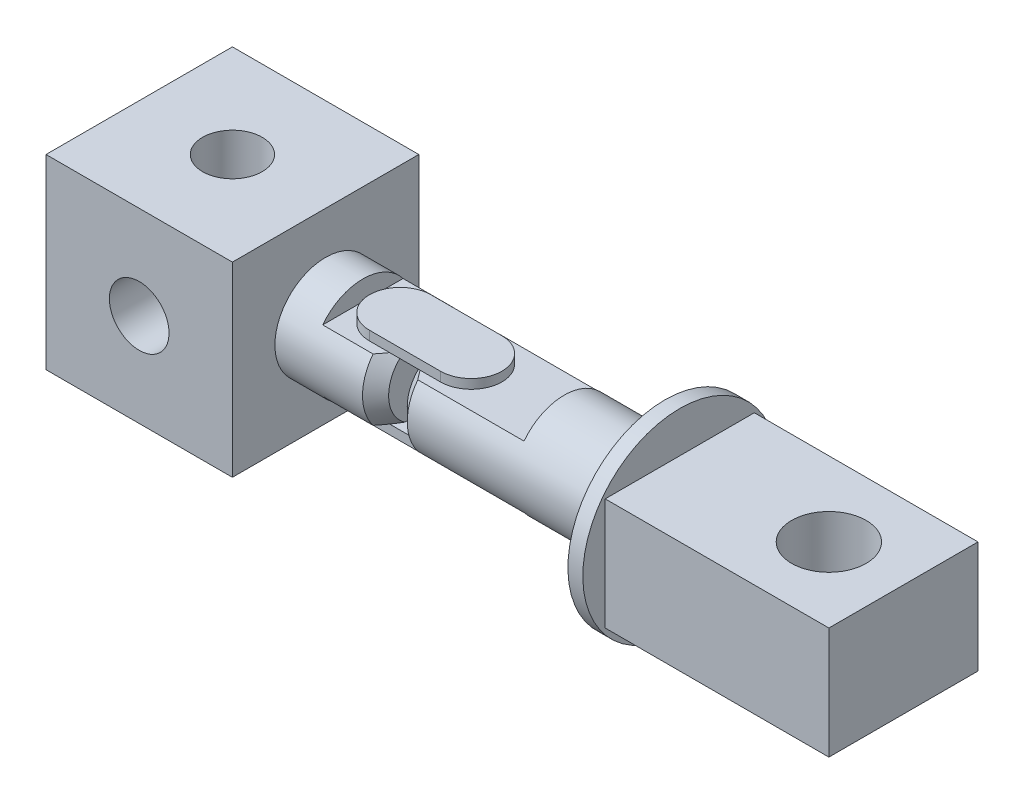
ISO-10303-21;
HEADER;
FILE_DESCRIPTION(('STEP AP214'),'2;1');
FILE_NAME('part.step','',(''),(''),'','','');
FILE_SCHEMA(('AUTOMOTIVE_DESIGN { 1 0 10303 214 1 1 1 1 }'));
ENDSEC;
DATA;
#1=APPLICATION_CONTEXT('core data for automotive mechanical design processes');
#2=APPLICATION_PROTOCOL_DEFINITION('international standard','automotive_design',2000,#1);
#3=PRODUCT_CONTEXT('',#1,'mechanical');
#4=PRODUCT('Part','Part','',(#3));
#5=PRODUCT_RELATED_PRODUCT_CATEGORY('part','',(#4));
#6=PRODUCT_DEFINITION_FORMATION('','',#4);
#7=PRODUCT_DEFINITION_CONTEXT('part definition',#1,'design');
#8=PRODUCT_DEFINITION('design','',#6,#7);
#9=PRODUCT_DEFINITION_SHAPE('','',#8);
#10=(LENGTH_UNIT() NAMED_UNIT(*) SI_UNIT(.MILLI.,.METRE.));
#11=(NAMED_UNIT(*) PLANE_ANGLE_UNIT() SI_UNIT($,.RADIAN.));
#12=(NAMED_UNIT(*) SI_UNIT($,.STERADIAN.) SOLID_ANGLE_UNIT());
#13=UNCERTAINTY_MEASURE_WITH_UNIT(LENGTH_MEASURE(1.E-05),#10,'distance_accuracy_value','');
#14=(GEOMETRIC_REPRESENTATION_CONTEXT(3) GLOBAL_UNCERTAINTY_ASSIGNED_CONTEXT((#13)) GLOBAL_UNIT_ASSIGNED_CONTEXT((#10,
#11,#12)) REPRESENTATION_CONTEXT('',''));
#15=CARTESIAN_POINT('',(0.,0.,0.));
#16=DIRECTION('',(0.,0.,1.));
#17=DIRECTION('',(1.,0.,0.));
#18=AXIS2_PLACEMENT_3D('',#15,#16,#17);
#19=CARTESIAN_POINT('',(26.,4.15,27.5));
#20=DIRECTION('',(0.,-1.,0.));
#21=DIRECTION('',(-1.,0.,0.));
#22=AXIS2_PLACEMENT_3D('',#19,#20,#21);
#23=PLANE('',#22);
#24=DIRECTION('',(-1.,0.,0.));
#25=VECTOR('',#24,1.);
#26=CARTESIAN_POINT('',(26.,4.15,8.38));
#27=LINE('',#26,#25);
#28=CARTESIAN_POINT('',(25.2021884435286,4.15,8.38));
#29=VERTEX_POINT('',#28);
#30=CARTESIAN_POINT('',(22.5,4.15,8.38));
#31=VERTEX_POINT('',#30);
#32=EDGE_CURVE('E358',#29,#31,#27,.T.);
#33=ORIENTED_EDGE('',*,*,#32,.F.);
#34=CARTESIAN_POINT('',(16.0225221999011,4.15,26.9430810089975));
#35=CARTESIAN_POINT('',(16.2992384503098,4.15,26.6551558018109));
#36=CARTESIAN_POINT('',(16.5756389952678,4.15,26.3669263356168));
#37=CARTESIAN_POINT('',(17.1276541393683,4.15,25.7897111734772));
#38=CARTESIAN_POINT('',(17.4032687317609,4.15,25.5007254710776));
#39=CARTESIAN_POINT('',(17.9536357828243,4.15,24.9217676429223));
#40=CARTESIAN_POINT('',(18.2283879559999,4.15,24.6317952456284));
#41=CARTESIAN_POINT('',(18.7767292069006,4.15,24.0507541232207));
#42=CARTESIAN_POINT('',(19.0503182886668,4.15,23.7596854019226));
#43=CARTESIAN_POINT('',(19.593590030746,4.15,23.1788249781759));
#44=CARTESIAN_POINT('',(19.8632856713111,4.15,22.8890454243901));
#45=CARTESIAN_POINT('',(20.4008812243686,4.15,22.3078258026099));
#46=CARTESIAN_POINT('',(20.6687811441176,4.15,22.0163857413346));
#47=CARTESIAN_POINT('',(21.2022326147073,4.15,21.4314294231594));
#48=CARTESIAN_POINT('',(21.4677844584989,4.15,21.1379134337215));
#49=CARTESIAN_POINT('',(21.9958338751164,4.15,20.5481502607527));
#50=CARTESIAN_POINT('',(22.2583315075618,4.15,20.2519031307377));
#51=CARTESIAN_POINT('',(22.7151422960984,4.15,19.7290578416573));
#52=CARTESIAN_POINT('',(22.9103516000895,4.15,19.5032436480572));
#53=CARTESIAN_POINT('',(23.2977309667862,4.15,19.0489901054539));
#54=CARTESIAN_POINT('',(23.4899008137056,4.15,18.8205505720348));
#55=CARTESIAN_POINT('',(23.8712993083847,4.15,18.3590316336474));
#56=CARTESIAN_POINT('',(24.0605050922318,4.15,18.1259332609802));
#57=CARTESIAN_POINT('',(24.4333602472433,4.15,17.6553885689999));
#58=CARTESIAN_POINT('',(24.6170106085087,4.15,17.417943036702));
#59=CARTESIAN_POINT('',(24.9782625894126,4.15,16.9350349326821));
#60=CARTESIAN_POINT('',(25.1557936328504,4.15,16.6895189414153));
#61=CARTESIAN_POINT('',(25.4135315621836,4.15,16.3151539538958));
#62=CARTESIAN_POINT('',(25.4980601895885,4.15,16.1892822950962));
#63=CARTESIAN_POINT('',(25.6635441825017,4.15,15.935217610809));
#64=CARTESIAN_POINT('',(25.7444998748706,4.15,15.8070247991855));
#65=CARTESIAN_POINT('',(25.9015806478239,4.15,15.5486366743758));
#66=CARTESIAN_POINT('',(25.9777292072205,4.15,15.4184557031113));
#67=CARTESIAN_POINT('',(26.124590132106,4.15,15.1550188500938));
#68=CARTESIAN_POINT('',(26.1953017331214,4.15,15.0217625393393));
#69=CARTESIAN_POINT('',(26.3297721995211,4.15,14.7520419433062));
#70=CARTESIAN_POINT('',(26.3935427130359,4.15,14.6155835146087));
#71=CARTESIAN_POINT('',(26.5125031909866,4.15,14.3390077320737));
#72=CARTESIAN_POINT('',(26.5676970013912,4.15,14.1988920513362));
#73=CARTESIAN_POINT('',(26.666910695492,4.15,13.9164222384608));
#74=CARTESIAN_POINT('',(26.7110458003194,4.15,13.7741091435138));
#75=CARTESIAN_POINT('',(26.7867043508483,4.15,13.4861347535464));
#76=CARTESIAN_POINT('',(26.8182298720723,4.15,13.3404740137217));
#77=CARTESIAN_POINT('',(26.8664899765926,4.15,13.0476691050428));
#78=CARTESIAN_POINT('',(26.8833216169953,4.15,12.9005412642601));
#79=CARTESIAN_POINT('',(26.9012771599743,4.15,12.6053218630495));
#80=CARTESIAN_POINT('',(26.9024025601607,4.15,12.4572303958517));
#81=CARTESIAN_POINT('',(26.8888549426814,4.15,12.1617159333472));
#82=CARTESIAN_POINT('',(26.874174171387,4.15,12.0142933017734));
#83=CARTESIAN_POINT('',(26.830126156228,4.15,11.7216762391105));
#84=CARTESIAN_POINT('',(26.800755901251,4.15,11.5764822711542));
#85=CARTESIAN_POINT('',(26.7289773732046,4.15,11.2882254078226));
#86=CARTESIAN_POINT('',(26.6864706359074,4.15,11.1451874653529));
#87=CARTESIAN_POINT('',(26.5907139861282,4.15,10.8628113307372));
#88=CARTESIAN_POINT('',(26.5374639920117,4.15,10.7234731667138));
#89=CARTESIAN_POINT('',(26.4074918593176,4.15,10.4131247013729));
#90=CARTESIAN_POINT('',(26.3282543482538,4.15,10.2431763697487));
#91=CARTESIAN_POINT('',(26.1594276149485,4.15,9.90845709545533));
#92=CARTESIAN_POINT('',(26.0698321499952,4.15,9.74368935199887));
#93=CARTESIAN_POINT('',(25.8826515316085,4.15,9.41832405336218));
#94=CARTESIAN_POINT('',(25.7850496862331,4.15,9.25773617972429));
#95=CARTESIAN_POINT('',(25.5839040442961,4.15,8.94039980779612));
#96=CARTESIAN_POINT('',(25.4803614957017,4.15,8.78365051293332));
#97=CARTESIAN_POINT('',(25.2675569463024,4.15,8.4716895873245));
#98=CARTESIAN_POINT('',(25.1582464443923,4.15,8.31651119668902));
#99=CARTESIAN_POINT('',(24.9359303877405,4.15,8.00882512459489));
#100=CARTESIAN_POINT('',(24.8229246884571,4.15,7.85631754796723));
#101=CARTESIAN_POINT('',(24.5941310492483,4.15,7.55373588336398));
#102=CARTESIAN_POINT('',(24.4783471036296,4.15,7.40365876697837));
#103=CARTESIAN_POINT('',(24.2444142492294,4.15,7.1053682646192));
#104=CARTESIAN_POINT('',(24.1262653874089,4.15,6.95715484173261));
#105=CARTESIAN_POINT('',(23.8472614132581,4.15,6.61182857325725));
#106=CARTESIAN_POINT('',(23.6856308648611,4.15,6.41534282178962));
#107=CARTESIAN_POINT('',(23.3596590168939,4.15,6.0246294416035));
#108=CARTESIAN_POINT('',(23.1953176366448,4.15,5.8304018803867));
#109=CARTESIAN_POINT('',(22.8644701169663,4.15,5.4437681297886));
#110=CARTESIAN_POINT('',(22.6979637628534,4.15,5.25136212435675));
#111=CARTESIAN_POINT('',(22.3632147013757,4.15,4.8680653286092));
#112=CARTESIAN_POINT('',(22.1949719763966,4.15,4.67717455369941));
#113=CARTESIAN_POINT('',(21.6877955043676,4.15,4.10600049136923));
#114=CARTESIAN_POINT('',(21.346743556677,4.15,3.72759849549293));
#115=CARTESIAN_POINT('',(20.6607718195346,4.15,2.9743705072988));
#116=CARTESIAN_POINT('',(20.3158522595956,4.15,2.59954430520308));
#117=CARTESIAN_POINT('',(19.6439523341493,4.15,1.87490269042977));
#118=CARTESIAN_POINT('',(19.3171360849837,4.15,1.52493494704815));
#119=CARTESIAN_POINT('',(18.6616043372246,4.15,0.826772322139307));
#120=CARTESIAN_POINT('',(18.3328888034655,4.15,0.478577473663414));
#121=CARTESIAN_POINT('',(17.6745519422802,4.15,-0.215829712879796));
#122=CARTESIAN_POINT('',(17.3449331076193,4.15,-0.562044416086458));
#123=CARTESIAN_POINT('',(16.6845313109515,4.15,-1.25334235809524));
#124=CARTESIAN_POINT('',(16.3537483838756,4.15,-1.59842563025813));
#125=CARTESIAN_POINT('',(16.0225221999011,4.15,-1.94308100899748));
#126=B_SPLINE_CURVE_WITH_KNOTS('',3,(#34,#35,#36,#37,#38,#39,#40,#41,#42,#43,#44,#45,#46,#47,
#48,#49,#50,#51,#52,#53,#54,#55,#56,#57,#58,#59,#60,#61,#62,#63,#64,#65,#66,#67,#68,#69,#70,#71,
#72,#73,#74,#75,#76,#77,#78,#79,#80,#81,#82,#83,#84,#85,#86,#87,#88,#89,#90,#91,#92,#93,#94,#95,
#96,#97,#98,#99,#100,#101,#102,#103,#104,#105,#106,#107,#108,#109,#110,#111,#112,#113,#114,#115,
#116,#117,#118,#119,#120,#121,#122,#123,#124,#125),.UNSPECIFIED.,.F.,.F.,(4,2,2,2,2,2,2,2,2,2,2,
2,2,2,2,2,2,2,2,2,2,2,2,2,2,2,2,2,2,2,2,2,2,2,2,2,2,2,2,2,2,2,2,2,2,4),(0.,1.19802206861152,
2.39605439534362,3.5944485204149,4.79283847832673,5.98042321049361,7.16800314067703,
8.35543275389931,9.54283914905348,10.4383009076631,11.3338259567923,12.2344302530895,
13.1348730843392,14.0435410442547,14.4983562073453,14.953129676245,15.4054755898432,
15.8578849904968,16.3095230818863,16.7609580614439,17.207473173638,17.6539147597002,
18.0973846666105,18.540812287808,18.984457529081,19.4281937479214,19.8753401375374,
20.3224899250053,20.8845411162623,21.4469328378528,22.0105283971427,22.5740059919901,
23.1433782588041,23.7127728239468,24.2813927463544,24.8500013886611,25.6132372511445,
26.3764958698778,27.1398307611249,27.9031734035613,29.4313754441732,30.9594872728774,
32.395993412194,33.8325262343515,35.2666148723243,36.7006608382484),.UNSPECIFIED.);
#127=CARTESIAN_POINT('',(24.25,4.15,7.11321060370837));
#128=VERTEX_POINT('',#127);
#129=EDGE_CURVE('E525',#29,#128,#126,.T.);
#130=ORIENTED_EDGE('',*,*,#129,.T.);
#131=DIRECTION('',(-1.,0.,0.));
#132=VECTOR('',#131,1.);
#133=CARTESIAN_POINT('',(26.,4.15,7.11321060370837));
#134=LINE('',#133,#132);
#135=CARTESIAN_POINT('',(17.5,4.15,7.11321060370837));
#136=VERTEX_POINT('',#135);
#137=EDGE_CURVE('E477',#136,#128,#134,.F.);
#138=ORIENTED_EDGE('',*,*,#137,.F.);
#139=DIRECTION('',(0.,0.,-1.));
#140=VECTOR('',#139,1.);
#141=CARTESIAN_POINT('',(17.5,4.15,27.5));
#142=LINE('',#141,#140);
#143=CARTESIAN_POINT('',(17.5,4.15,17.8867893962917));
#144=VERTEX_POINT('',#143);
#145=EDGE_CURVE('E473',#144,#136,#142,.T.);
#146=ORIENTED_EDGE('',*,*,#145,.F.);
#147=DIRECTION('',(-1.,0.,0.));
#148=VECTOR('',#147,1.);
#149=CARTESIAN_POINT('',(26.,4.15,17.8867893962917));
#150=LINE('',#149,#148);
#151=CARTESIAN_POINT('',(24.25,4.15,17.8867893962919));
#152=VERTEX_POINT('',#151);
#153=EDGE_CURVE('E482',#152,#144,#150,.T.);
#154=ORIENTED_EDGE('',*,*,#153,.F.);
#155=CARTESIAN_POINT('',(25.2021884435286,4.15,16.62));
#156=VERTEX_POINT('',#155);
#157=EDGE_CURVE('E534',#152,#156,#126,.T.);
#158=ORIENTED_EDGE('',*,*,#157,.T.);
#159=DIRECTION('',(1.,0.,0.));
#160=VECTOR('',#159,1.);
#161=CARTESIAN_POINT('',(32.025,4.15,16.62));
#162=LINE('',#161,#160);
#163=CARTESIAN_POINT('',(22.5,4.15,16.62));
#164=VERTEX_POINT('',#163);
#165=EDGE_CURVE('E640',#164,#156,#162,.T.);
#166=ORIENTED_EDGE('',*,*,#165,.F.);
#167=CARTESIAN_POINT('',(22.5,4.15,12.5));
#168=DIRECTION('',(0.,1.,0.));
#169=DIRECTION('',(0.,0.,1.));
#170=AXIS2_PLACEMENT_3D('',#167,#168,#169);
#171=CIRCLE('',#170,4.12);
#172=EDGE_CURVE('E437',#31,#164,#171,.T.);
#173=ORIENTED_EDGE('',*,*,#172,.F.);
#174=EDGE_LOOP('',(#33,#130,#138,#146,#154,#158,#166,#173));
#175=FACE_BOUND('',#174,.T.);
#176=ADVANCED_FACE('F14',(#175),#23,.F.);
#177=CARTESIAN_POINT('',(0.,12.5,12.5));
#178=DIRECTION('',(0.,1.,0.));
#179=DIRECTION('',(0.,0.,1.));
#180=AXIS2_PLACEMENT_3D('',#177,#178,#179);
#181=CYLINDRICAL_SURFACE('',#180,4.);
#182=CARTESIAN_POINT('',(0.,12.5,12.5));
#183=DIRECTION('',(0.,1.,0.));
#184=DIRECTION('',(0.,0.,1.));
#185=AXIS2_PLACEMENT_3D('',#182,#183,#184);
#186=CIRCLE('',#185,4.);
#187=CARTESIAN_POINT('',(0.,12.5,16.5));
#188=VERTEX_POINT('',#187);
#189=EDGE_CURVE('E455',#188,#188,#186,.T.);
#190=ORIENTED_EDGE('',*,*,#189,.T.);
#191=EDGE_LOOP('',(#190));
#192=FACE_BOUND('',#191,.T.);
#193=CARTESIAN_POINT('',(0.,0.,12.5));
#194=DIRECTION('',(0.,0.707106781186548,-0.707106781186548));
#195=DIRECTION('',(0.,0.707106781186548,0.707106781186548));
#196=AXIS2_PLACEMENT_3D('',#193,#194,#195);
#197=ELLIPSE('',#196,5.65685424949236,4.);
#198=CARTESIAN_POINT('',(4.,0.,12.5));
#199=VERTEX_POINT('',#198);
#200=CARTESIAN_POINT('',(-4.,0.,12.5));
#201=VERTEX_POINT('',#200);
#202=EDGE_CURVE('E413',#199,#201,#197,.F.);
#203=ORIENTED_EDGE('',*,*,#202,.T.);
#204=CARTESIAN_POINT('',(0.,0.,12.5));
#205=DIRECTION('',(0.,0.707106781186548,0.707106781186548));
#206=DIRECTION('',(0.,0.707106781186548,-0.707106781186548));
#207=AXIS2_PLACEMENT_3D('',#204,#205,#206);
#208=ELLIPSE('',#207,5.65685424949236,4.);
#209=EDGE_CURVE('E420',#201,#199,#208,.F.);
#210=ORIENTED_EDGE('',*,*,#209,.T.);
#211=EDGE_LOOP('',(#203,#210));
#212=FACE_BOUND('',#211,.T.);
#213=ADVANCED_FACE('F391',(#192,#212),#181,.F.);
#214=CARTESIAN_POINT('',(26.,0.,12.5));
#215=DIRECTION('',(-1.,0.,0.));
#216=DIRECTION('',(0.,1.,0.));
#217=AXIS2_PLACEMENT_3D('',#214,#215,#216);
#218=CONICAL_SURFACE('',#217,5.05,0.785398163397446);
#219=CARTESIAN_POINT('',(16.0225221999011,-4.15,-1.94308100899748));
#220=CARTESIAN_POINT('',(16.2992384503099,-4.15,-1.65515580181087));
#221=CARTESIAN_POINT('',(16.5756389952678,-4.15,-1.36692633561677));
#222=CARTESIAN_POINT('',(17.1276541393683,-4.15,-0.789711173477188));
#223=CARTESIAN_POINT('',(17.4032687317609,-4.15,-0.500725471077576));
#224=CARTESIAN_POINT('',(17.9536357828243,-4.15,0.0782323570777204));
#225=CARTESIAN_POINT('',(18.2283879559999,-4.15,0.368204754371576));
#226=CARTESIAN_POINT('',(18.7767292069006,-4.15,0.949245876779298));
#227=CARTESIAN_POINT('',(19.0503182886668,-4.15,1.24031459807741));
#228=CARTESIAN_POINT('',(19.593590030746,-4.15,1.82117502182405));
#229=CARTESIAN_POINT('',(19.8632856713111,-4.15,2.11095457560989));
#230=CARTESIAN_POINT('',(20.4008812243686,-4.15,2.69217419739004));
#231=CARTESIAN_POINT('',(20.6687811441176,-4.15,2.98361425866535));
#232=CARTESIAN_POINT('',(21.2022326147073,-4.15,3.56857057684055));
#233=CARTESIAN_POINT('',(21.4677844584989,-4.15,3.86208656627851));
#234=CARTESIAN_POINT('',(21.9958338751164,-4.15,4.45184973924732));
#235=CARTESIAN_POINT('',(22.2583315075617,-4.15,4.74809686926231));
#236=CARTESIAN_POINT('',(22.7151422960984,-4.15,5.27094215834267));
#237=CARTESIAN_POINT('',(22.9103516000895,-4.15,5.49675635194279));
#238=CARTESIAN_POINT('',(23.2977309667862,-4.15,5.95100989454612));
#239=CARTESIAN_POINT('',(23.4899008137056,-4.15,6.17944942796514));
#240=CARTESIAN_POINT('',(23.8712993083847,-4.15,6.64096836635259));
#241=CARTESIAN_POINT('',(24.0605050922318,-4.15,6.87406673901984));
#242=CARTESIAN_POINT('',(24.4333602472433,-4.15,7.34461143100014));
#243=CARTESIAN_POINT('',(24.6170106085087,-4.15,7.58205696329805));
#244=CARTESIAN_POINT('',(24.9782625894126,-4.15,8.06496506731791));
#245=CARTESIAN_POINT('',(25.1557936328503,-4.15,8.31048105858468));
#246=CARTESIAN_POINT('',(25.4135315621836,-4.15,8.68484604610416));
#247=CARTESIAN_POINT('',(25.4980601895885,-4.15,8.81071770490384));
#248=CARTESIAN_POINT('',(25.6635441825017,-4.15,9.06478238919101));
#249=CARTESIAN_POINT('',(25.7444998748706,-4.15,9.19297520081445));
#250=CARTESIAN_POINT('',(25.9015806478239,-4.15,9.45136332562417));
#251=CARTESIAN_POINT('',(25.9777292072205,-4.15,9.58154429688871));
#252=CARTESIAN_POINT('',(26.124590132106,-4.15,9.84498114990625));
#253=CARTESIAN_POINT('',(26.1953017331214,-4.15,9.97823746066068));
#254=CARTESIAN_POINT('',(26.3297721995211,-4.15,10.2479580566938));
#255=CARTESIAN_POINT('',(26.3935427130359,-4.15,10.3844164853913));
#256=CARTESIAN_POINT('',(26.5125031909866,-4.15,10.6609922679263));
#257=CARTESIAN_POINT('',(26.5676970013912,-4.15,10.8011079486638));
#258=CARTESIAN_POINT('',(26.666910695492,-4.15,11.0835777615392));
#259=CARTESIAN_POINT('',(26.7110458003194,-4.15,11.2258908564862));
#260=CARTESIAN_POINT('',(26.7867043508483,-4.15,11.5138652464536));
#261=CARTESIAN_POINT('',(26.8182298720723,-4.15,11.6595259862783));
#262=CARTESIAN_POINT('',(26.8664899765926,-4.15,11.9523308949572));
#263=CARTESIAN_POINT('',(26.8833216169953,-4.15,12.0994587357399));
#264=CARTESIAN_POINT('',(26.9012771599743,-4.15,12.3946781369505));
#265=CARTESIAN_POINT('',(26.9024025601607,-4.15,12.5427696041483));
#266=CARTESIAN_POINT('',(26.8888549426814,-4.15,12.8382840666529));
#267=CARTESIAN_POINT('',(26.874174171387,-4.15,12.9857066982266));
#268=CARTESIAN_POINT('',(26.830126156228,-4.15,13.2783237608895));
#269=CARTESIAN_POINT('',(26.800755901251,-4.15,13.4235177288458));
#270=CARTESIAN_POINT('',(26.7289773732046,-4.15,13.7117745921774));
#271=CARTESIAN_POINT('',(26.6864706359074,-4.15,13.8548125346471));
#272=CARTESIAN_POINT('',(26.5907139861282,-4.15,14.1371886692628));
#273=CARTESIAN_POINT('',(26.5374639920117,-4.15,14.2765268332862));
#274=CARTESIAN_POINT('',(26.4074918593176,-4.15,14.5868752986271));
#275=CARTESIAN_POINT('',(26.3282543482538,-4.15,14.7568236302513));
#276=CARTESIAN_POINT('',(26.1594276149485,-4.15,15.0915429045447));
#277=CARTESIAN_POINT('',(26.0698321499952,-4.15,15.2563106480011));
#278=CARTESIAN_POINT('',(25.8826515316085,-4.15,15.5816759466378));
#279=CARTESIAN_POINT('',(25.7850496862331,-4.15,15.7422638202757));
#280=CARTESIAN_POINT('',(25.5839040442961,-4.15,16.0596001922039));
#281=CARTESIAN_POINT('',(25.4803614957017,-4.15,16.2163494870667));
#282=CARTESIAN_POINT('',(25.2675569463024,-4.15,16.5283104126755));
#283=CARTESIAN_POINT('',(25.1582464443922,-4.15,16.683488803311));
#284=CARTESIAN_POINT('',(24.9359303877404,-4.15,16.9911748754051));
#285=CARTESIAN_POINT('',(24.822924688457,-4.15,17.1436824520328));
#286=CARTESIAN_POINT('',(24.5941310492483,-4.15,17.4462641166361));
#287=CARTESIAN_POINT('',(24.4783471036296,-4.15,17.5963412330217));
#288=CARTESIAN_POINT('',(24.2444142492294,-4.15,17.8946317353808));
#289=CARTESIAN_POINT('',(24.1262653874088,-4.15,18.0428451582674));
#290=CARTESIAN_POINT('',(23.847261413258,-4.15,18.3881714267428));
#291=CARTESIAN_POINT('',(23.6856308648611,-4.15,18.5846571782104));
#292=CARTESIAN_POINT('',(23.3596590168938,-4.15,18.9753705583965));
#293=CARTESIAN_POINT('',(23.1953176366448,-4.15,19.1695981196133));
#294=CARTESIAN_POINT('',(22.8644701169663,-4.15,19.5562318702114));
#295=CARTESIAN_POINT('',(22.6979637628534,-4.15,19.7486378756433));
#296=CARTESIAN_POINT('',(22.3632147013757,-4.15,20.1319346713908));
#297=CARTESIAN_POINT('',(22.1949719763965,-4.15,20.3228254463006));
#298=CARTESIAN_POINT('',(21.6877955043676,-4.15,20.8939995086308));
#299=CARTESIAN_POINT('',(21.3467435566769,-4.15,21.2724015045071));
#300=CARTESIAN_POINT('',(20.6607718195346,-4.15,22.0256294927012));
#301=CARTESIAN_POINT('',(20.3158522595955,-4.15,22.4004556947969));
#302=CARTESIAN_POINT('',(19.6439523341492,-4.15,23.1250973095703));
#303=CARTESIAN_POINT('',(19.3171360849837,-4.15,23.4750650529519));
#304=CARTESIAN_POINT('',(18.6616043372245,-4.15,24.1732276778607));
#305=CARTESIAN_POINT('',(18.3328888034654,-4.15,24.5214225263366));
#306=CARTESIAN_POINT('',(17.6745519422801,-4.15,25.2158297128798));
#307=CARTESIAN_POINT('',(17.3449331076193,-4.15,25.5620444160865));
#308=CARTESIAN_POINT('',(16.6845313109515,-4.15,26.2533423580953));
#309=CARTESIAN_POINT('',(16.3537483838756,-4.15,26.5984256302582));
#310=CARTESIAN_POINT('',(16.0225221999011,-4.15,26.9430810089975));
#311=B_SPLINE_CURVE_WITH_KNOTS('',3,(#219,#220,#221,#222,#223,#224,#225,#226,#227,#228,#229,
#230,#231,#232,#233,#234,#235,#236,#237,#238,#239,#240,#241,#242,#243,#244,#245,#246,#247,#248,
#249,#250,#251,#252,#253,#254,#255,#256,#257,#258,#259,#260,#261,#262,#263,#264,#265,#266,#267,
#268,#269,#270,#271,#272,#273,#274,#275,#276,#277,#278,#279,#280,#281,#282,#283,#284,#285,#286,
#287,#288,#289,#290,#291,#292,#293,#294,#295,#296,#297,#298,#299,#300,#301,#302,#303,#304,#305,
#306,#307,#308,#309,#310),.UNSPECIFIED.,.F.,.F.,(4,2,2,2,2,2,2,2,2,2,2,2,2,2,2,2,2,2,2,2,2,2,2,
2,2,2,2,2,2,2,2,2,2,2,2,2,2,2,2,2,2,2,2,2,2,4),(0.,1.19802206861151,2.3960543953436,
3.59444852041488,4.7928384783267,5.98042321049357,7.16800314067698,8.35543275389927,
9.54283914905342,10.438300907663,11.3338259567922,12.2344302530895,13.1348730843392,
14.0435410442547,14.4983562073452,14.9531296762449,15.4054755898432,15.8578849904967,
16.3095230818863,16.7609580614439,17.207473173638,17.6539147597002,18.0973846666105,
18.540812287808,18.984457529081,19.4281937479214,19.8753401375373,20.3224899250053,
20.8845411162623,21.4469328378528,22.0105283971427,22.5740059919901,23.1433782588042,
23.7127728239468,24.2813927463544,24.8500013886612,25.6132372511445,26.3764958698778,
27.1398307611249,27.9031734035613,29.4313754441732,30.9594872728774,32.395993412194,
33.8325262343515,35.2666148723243,36.7006608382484),.UNSPECIFIED.);
#312=CARTESIAN_POINT('',(24.25,-4.15,7.11321060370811));
#313=VERTEX_POINT('',#312);
#314=CARTESIAN_POINT('',(25.2021884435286,-4.15,8.38));
#315=VERTEX_POINT('',#314);
#316=EDGE_CURVE('E406',#313,#315,#311,.T.);
#317=ORIENTED_EDGE('',*,*,#316,.F.);
#318=CARTESIAN_POINT('',(24.25,0.,12.5));
#319=DIRECTION('',(1.,0.,0.));
#320=DIRECTION('',(0.,-1.,0.));
#321=AXIS2_PLACEMENT_3D('',#318,#319,#320);
#322=CIRCLE('',#321,6.8);
#323=EDGE_CURVE('E523',#128,#313,#322,.F.);
#324=ORIENTED_EDGE('',*,*,#323,.F.);
#325=ORIENTED_EDGE('',*,*,#129,.F.);
#326=CARTESIAN_POINT('',(26.,4.15,9.62250108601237));
#327=VERTEX_POINT('',#326);
#328=EDGE_CURVE('E526',#327,#29,#126,.T.);
#329=ORIENTED_EDGE('',*,*,#328,.F.);
#330=CARTESIAN_POINT('',(26.,0.,12.5));
#331=DIRECTION('',(1.,0.,0.));
#332=DIRECTION('',(0.,-1.,0.));
#333=AXIS2_PLACEMENT_3D('',#330,#331,#332);
#334=CIRCLE('',#333,5.05);
#335=CARTESIAN_POINT('',(26.,-4.15,9.62250108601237));
#336=VERTEX_POINT('',#335);
#337=EDGE_CURVE('E518',#336,#327,#334,.T.);
#338=ORIENTED_EDGE('',*,*,#337,.F.);
#339=CARTESIAN_POINT('',(26.7277682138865,-4.15,11.292031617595));
#340=CARTESIAN_POINT('',(26.7028787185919,-4.15,11.2029710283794));
#341=CARTESIAN_POINT('',(26.6756425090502,-4.15,11.1145994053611));
#342=CARTESIAN_POINT('',(26.6170024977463,-4.15,10.939301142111));
#343=CARTESIAN_POINT('',(26.5856010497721,-4.15,10.8523737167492));
#344=CARTESIAN_POINT('',(26.4860845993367,-4.15,10.5942130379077));
#345=CARTESIAN_POINT('',(26.4125060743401,-4.15,10.4250809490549));
#346=CARTESIAN_POINT('',(26.254920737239,-4.15,10.0934641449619));
#347=CARTESIAN_POINT('',(26.1709992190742,-4.15,9.93093805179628));
#348=CARTESIAN_POINT('',(25.9948256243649,-4.15,9.6103225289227));
#349=CARTESIAN_POINT('',(25.9025665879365,-4.15,9.45223695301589));
#350=CARTESIAN_POINT('',(25.7180134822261,-4.15,9.15023929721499));
#351=CARTESIAN_POINT('',(25.6261216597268,-4.15,9.00607932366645));
#352=CARTESIAN_POINT('',(25.4379853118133,-4.15,8.72061778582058));
#353=CARTESIAN_POINT('',(25.341740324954,-4.15,8.57931652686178));
#354=CARTESIAN_POINT('',(25.145760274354,-4.15,8.2990985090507));
#355=CARTESIAN_POINT('',(25.046024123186,-4.15,8.16018251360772));
#356=CARTESIAN_POINT('',(24.843754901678,-4.15,7.88440034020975));
#357=CARTESIAN_POINT('',(24.741221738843,-4.15,7.74753423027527));
#358=CARTESIAN_POINT('',(24.5322628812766,-4.15,7.47343214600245));
#359=CARTESIAN_POINT('',(24.425801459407,-4.15,7.336223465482));
#360=CARTESIAN_POINT('',(24.2109364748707,-4.15,7.06333194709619));
#361=CARTESIAN_POINT('',(24.1025328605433,-4.15,6.92764914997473));
#362=CARTESIAN_POINT('',(23.8842987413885,-4.15,6.6578196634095));
#363=CARTESIAN_POINT('',(23.7744709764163,-4.15,6.5236707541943));
#364=CARTESIAN_POINT('',(23.553461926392,-4.15,6.25651065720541));
#365=CARTESIAN_POINT('',(23.4422807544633,-4.15,6.12349937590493));
#366=CARTESIAN_POINT('',(23.3305405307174,-4.15,5.99096362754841));
#367=B_SPLINE_CURVE_WITH_KNOTS('',3,(#339,#340,#341,#342,#343,#344,#345,#346,#347,#348,#349,
#350,#351,#352,#353,#354,#355,#356,#357,#358,#359,#360,#361,#362,#363,#364,#365,#366),
.UNSPECIFIED.,.F.,.F.,(4,2,2,2,2,2,2,2,2,2,2,2,2,4),(0.,0.277337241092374,0.554518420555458,
1.10726069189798,1.65571656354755,2.20463457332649,2.7174115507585,3.23024301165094,
3.74323565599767,4.25624528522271,4.77722569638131,5.29821998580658,5.81832833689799,
6.33839350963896),.UNSPECIFIED.);
#368=EDGE_CURVE('E240',#336,#315,#367,.T.);
#369=ORIENTED_EDGE('',*,*,#368,.T.);
#370=EDGE_LOOP('',(#317,#324,#325,#329,#338,#369));
#371=FACE_BOUND('',#370,.T.);
#372=ADVANCED_FACE('F560',(#371),#218,.T.);
#373=CARTESIAN_POINT('',(12.5,-12.5,25.));
#374=DIRECTION('',(-1.,0.,0.));
#375=DIRECTION('',(0.,1.,0.));
#376=AXIS2_PLACEMENT_3D('',#373,#374,#375);
#377=PLANE('',#376);
#378=DIRECTION('',(0.,0.,1.));
#379=VECTOR('',#378,1.);
#380=CARTESIAN_POINT('',(12.5,12.5,25.));
#381=LINE('',#380,#379);
#382=CARTESIAN_POINT('',(12.5,12.5,0.));
#383=VERTEX_POINT('',#382);
#384=CARTESIAN_POINT('',(12.5,12.5,25.));
#385=VERTEX_POINT('',#384);
#386=EDGE_CURVE('E490',#383,#385,#381,.T.);
#387=ORIENTED_EDGE('',*,*,#386,.T.);
#388=DIRECTION('',(0.,1.,0.));
#389=VECTOR('',#388,1.);
#390=CARTESIAN_POINT('',(12.5,-12.5,25.));
#391=LINE('',#390,#389);
#392=CARTESIAN_POINT('',(12.5,-12.5,25.));
#393=VERTEX_POINT('',#392);
#394=EDGE_CURVE('E496',#393,#385,#391,.T.);
#395=ORIENTED_EDGE('',*,*,#394,.F.);
#396=DIRECTION('',(0.,0.,1.));
#397=VECTOR('',#396,1.);
#398=CARTESIAN_POINT('',(12.5,-12.5,25.));
#399=LINE('',#398,#397);
#400=CARTESIAN_POINT('',(12.5,-12.5,0.));
#401=VERTEX_POINT('',#400);
#402=EDGE_CURVE('E494',#401,#393,#399,.T.);
#403=ORIENTED_EDGE('',*,*,#402,.F.);
#404=DIRECTION('',(0.,1.,0.));
#405=VECTOR('',#404,1.);
#406=CARTESIAN_POINT('',(12.5,-12.5,0.));
#407=LINE('',#406,#405);
#408=EDGE_CURVE('E506',#401,#383,#407,.T.);
#409=ORIENTED_EDGE('',*,*,#408,.T.);
#410=EDGE_LOOP('',(#387,#395,#403,#409));
#411=FACE_BOUND('',#410,.T.);
#412=CARTESIAN_POINT('',(12.5,0.,12.5));
#413=DIRECTION('',(-1.,0.,0.));
#414=DIRECTION('',(0.,1.,0.));
#415=AXIS2_PLACEMENT_3D('',#412,#413,#414);
#416=CIRCLE('',#415,6.8);
#417=CARTESIAN_POINT('',(12.5,6.8,12.5));
#418=VERTEX_POINT('',#417);
#419=EDGE_CURVE('E515',#418,#418,#416,.F.);
#420=ORIENTED_EDGE('',*,*,#419,.F.);
#421=EDGE_LOOP('',(#420));
#422=FACE_BOUND('',#421,.T.);
#423=ADVANCED_FACE('F556',(#411,#422),#377,.F.);
#424=CARTESIAN_POINT('',(12.5,-12.5,25.));
#425=DIRECTION('',(0.,0.,-1.));
#426=DIRECTION('',(1.,0.,0.));
#427=AXIS2_PLACEMENT_3D('',#424,#425,#426);
#428=PLANE('',#427);
#429=CARTESIAN_POINT('',(0.,0.,25.));
#430=DIRECTION('',(0.,0.,1.));
#431=DIRECTION('',(0.,-1.,0.));
#432=AXIS2_PLACEMENT_3D('',#429,#430,#431);
#433=CIRCLE('',#432,4.);
#434=CARTESIAN_POINT('',(0.,-4.,25.));
#435=VERTEX_POINT('',#434);
#436=EDGE_CURVE('E444',#435,#435,#433,.T.);
#437=ORIENTED_EDGE('',*,*,#436,.F.);
#438=EDGE_LOOP('',(#437));
#439=FACE_BOUND('',#438,.T.);
#440=DIRECTION('',(-1.,0.,0.));
#441=VECTOR('',#440,1.);
#442=CARTESIAN_POINT('',(12.5,12.5,25.));
#443=LINE('',#442,#441);
#444=CARTESIAN_POINT('',(-12.5,12.5,25.));
#445=VERTEX_POINT('',#444);
#446=EDGE_CURVE('E485',#385,#445,#443,.T.);
#447=ORIENTED_EDGE('',*,*,#446,.T.);
#448=DIRECTION('',(0.,1.,0.));
#449=VECTOR('',#448,1.);
#450=CARTESIAN_POINT('',(-12.5,-12.5,25.));
#451=LINE('',#450,#449);
#452=CARTESIAN_POINT('',(-12.5,-12.5,25.));
#453=VERTEX_POINT('',#452);
#454=EDGE_CURVE('E512',#453,#445,#451,.T.);
#455=ORIENTED_EDGE('',*,*,#454,.F.);
#456=DIRECTION('',(-1.,0.,0.));
#457=VECTOR('',#456,1.);
#458=CARTESIAN_POINT('',(12.5,-12.5,25.));
#459=LINE('',#458,#457);
#460=EDGE_CURVE('E486',#393,#453,#459,.T.);
#461=ORIENTED_EDGE('',*,*,#460,.F.);
#462=ORIENTED_EDGE('',*,*,#394,.T.);
#463=EDGE_LOOP('',(#447,#455,#461,#462));
#464=FACE_BOUND('',#463,.T.);
#465=ADVANCED_FACE('F559',(#439,#464),#428,.F.);
#466=CARTESIAN_POINT('',(-12.5,-12.5,25.));
#467=DIRECTION('',(1.,0.,0.));
#468=DIRECTION('',(0.,-1.,0.));
#469=AXIS2_PLACEMENT_3D('',#466,#467,#468);
#470=PLANE('',#469);
#471=DIRECTION('',(0.,0.,-1.));
#472=VECTOR('',#471,1.);
#473=CARTESIAN_POINT('',(-12.5,12.5,25.));
#474=LINE('',#473,#472);
#475=CARTESIAN_POINT('',(-12.5,12.5,0.));
#476=VERTEX_POINT('',#475);
#477=EDGE_CURVE('E499',#445,#476,#474,.T.);
#478=ORIENTED_EDGE('',*,*,#477,.T.);
#479=DIRECTION('',(0.,1.,0.));
#480=VECTOR('',#479,1.);
#481=CARTESIAN_POINT('',(-12.5,-12.5,0.));
#482=LINE('',#481,#480);
#483=CARTESIAN_POINT('',(-12.5,-12.5,0.));
#484=VERTEX_POINT('',#483);
#485=EDGE_CURVE('E509',#484,#476,#482,.T.);
#486=ORIENTED_EDGE('',*,*,#485,.F.);
#487=DIRECTION('',(0.,0.,-1.));
#488=VECTOR('',#487,1.);
#489=CARTESIAN_POINT('',(-12.5,-12.5,25.));
#490=LINE('',#489,#488);
#491=EDGE_CURVE('E489',#453,#484,#490,.T.);
#492=ORIENTED_EDGE('',*,*,#491,.F.);
#493=ORIENTED_EDGE('',*,*,#454,.T.);
#494=EDGE_LOOP('',(#478,#486,#492,#493));
#495=FACE_BOUND('',#494,.T.);
#496=ADVANCED_FACE('F564',(#495),#470,.F.);
#497=CARTESIAN_POINT('',(12.5,-12.5,0.));
#498=DIRECTION('',(0.,0.,1.));
#499=DIRECTION('',(-1.,0.,0.));
#500=AXIS2_PLACEMENT_3D('',#497,#498,#499);
#501=PLANE('',#500);
#502=CARTESIAN_POINT('',(0.,0.,0.));
#503=DIRECTION('',(0.,0.,1.));
#504=DIRECTION('',(-1.,0.,0.));
#505=AXIS2_PLACEMENT_3D('',#502,#503,#504);
#506=CIRCLE('',#505,4.);
#507=CARTESIAN_POINT('',(-4.,0.,0.));
#508=VERTEX_POINT('',#507);
#509=EDGE_CURVE('E452',#508,#508,#506,.T.);
#510=ORIENTED_EDGE('',*,*,#509,.T.);
#511=EDGE_LOOP('',(#510));
#512=FACE_BOUND('',#511,.T.);
#513=DIRECTION('',(1.,0.,0.));
#514=VECTOR('',#513,1.);
#515=CARTESIAN_POINT('',(12.5,12.5,0.));
#516=LINE('',#515,#514);
#517=EDGE_CURVE('E501',#476,#383,#516,.T.);
#518=ORIENTED_EDGE('',*,*,#517,.T.);
#519=ORIENTED_EDGE('',*,*,#408,.F.);
#520=DIRECTION('',(1.,0.,0.));
#521=VECTOR('',#520,1.);
#522=CARTESIAN_POINT('',(12.5,-12.5,0.));
#523=LINE('',#522,#521);
#524=EDGE_CURVE('E492',#484,#401,#523,.T.);
#525=ORIENTED_EDGE('',*,*,#524,.F.);
#526=ORIENTED_EDGE('',*,*,#485,.T.);
#527=EDGE_LOOP('',(#518,#519,#525,#526));
#528=FACE_BOUND('',#527,.T.);
#529=ADVANCED_FACE('F551',(#512,#528),#501,.F.);
#530=CARTESIAN_POINT('',(-12.5,-12.5,25.));
#531=DIRECTION('',(0.,-1.,0.));
#532=DIRECTION('',(0.,0.,-1.));
#533=AXIS2_PLACEMENT_3D('',#530,#531,#532);
#534=PLANE('',#533);
#535=CARTESIAN_POINT('',(0.,-12.5,12.5));
#536=DIRECTION('',(0.,-1.,0.));
#537=DIRECTION('',(0.,0.,-1.));
#538=AXIS2_PLACEMENT_3D('',#535,#536,#537);
#539=CIRCLE('',#538,4.);
#540=CARTESIAN_POINT('',(0.,-12.5,8.5));
#541=VERTEX_POINT('',#540);
#542=EDGE_CURVE('E458',#541,#541,#539,.T.);
#543=ORIENTED_EDGE('',*,*,#542,.F.);
#544=EDGE_LOOP('',(#543));
#545=FACE_BOUND('',#544,.T.);
#546=ORIENTED_EDGE('',*,*,#460,.T.);
#547=ORIENTED_EDGE('',*,*,#491,.T.);
#548=ORIENTED_EDGE('',*,*,#524,.T.);
#549=ORIENTED_EDGE('',*,*,#402,.T.);
#550=EDGE_LOOP('',(#546,#547,#548,#549));
#551=FACE_BOUND('',#550,.T.);
#552=ADVANCED_FACE('F548',(#545,#551),#534,.T.);
#553=CARTESIAN_POINT('',(-12.5,12.5,25.));
#554=DIRECTION('',(0.,-1.,0.));
#555=DIRECTION('',(0.,0.,-1.));
#556=AXIS2_PLACEMENT_3D('',#553,#554,#555);
#557=PLANE('',#556);
#558=ORIENTED_EDGE('',*,*,#189,.F.);
#559=EDGE_LOOP('',(#558));
#560=FACE_BOUND('',#559,.T.);
#561=ORIENTED_EDGE('',*,*,#446,.F.);
#562=ORIENTED_EDGE('',*,*,#386,.F.);
#563=ORIENTED_EDGE('',*,*,#517,.F.);
#564=ORIENTED_EDGE('',*,*,#477,.F.);
#565=EDGE_LOOP('',(#561,#562,#563,#564));
#566=FACE_BOUND('',#565,.T.);
#567=ADVANCED_FACE('F546',(#560,#566),#557,.F.);
#568=CARTESIAN_POINT('',(26.,0.,12.5));
#569=DIRECTION('',(-1.,0.,0.));
#570=DIRECTION('',(0.,1.,0.));
#571=AXIS2_PLACEMENT_3D('',#568,#569,#570);
#572=CYLINDRICAL_SURFACE('',#571,6.8);
#573=ORIENTED_EDGE('',*,*,#323,.T.);
#574=DIRECTION('',(-1.,0.,0.));
#575=VECTOR('',#574,1.);
#576=CARTESIAN_POINT('',(26.,-4.15,7.11321060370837));
#577=LINE('',#576,#575);
#578=CARTESIAN_POINT('',(17.5,-4.15,7.11321060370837));
#579=VERTEX_POINT('',#578);
#580=EDGE_CURVE('E470',#313,#579,#577,.T.);
#581=ORIENTED_EDGE('',*,*,#580,.T.);
#582=CARTESIAN_POINT('',(17.5,0.,12.5));
#583=DIRECTION('',(-1.,0.,0.));
#584=DIRECTION('',(0.,1.,0.));
#585=AXIS2_PLACEMENT_3D('',#582,#583,#584);
#586=CIRCLE('',#585,6.8);
#587=CARTESIAN_POINT('',(17.5,-4.15,17.8867893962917));
#588=VERTEX_POINT('',#587);
#589=EDGE_CURVE('E410',#579,#588,#586,.T.);
#590=ORIENTED_EDGE('',*,*,#589,.T.);
#591=DIRECTION('',(-1.,0.,0.));
#592=VECTOR('',#591,1.);
#593=CARTESIAN_POINT('',(26.,-4.15,17.8867893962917));
#594=LINE('',#593,#592);
#595=CARTESIAN_POINT('',(24.25,-4.15,17.8867893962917));
#596=VERTEX_POINT('',#595);
#597=EDGE_CURVE('E465',#588,#596,#594,.F.);
#598=ORIENTED_EDGE('',*,*,#597,.T.);
#599=EDGE_CURVE('E522',#596,#152,#322,.F.);
#600=ORIENTED_EDGE('',*,*,#599,.T.);
#601=ORIENTED_EDGE('',*,*,#153,.T.);
#602=CARTESIAN_POINT('',(17.5,0.,12.5));
#603=DIRECTION('',(-1.,0.,0.));
#604=DIRECTION('',(0.,1.,0.));
#605=AXIS2_PLACEMENT_3D('',#602,#603,#604);
#606=CIRCLE('',#605,6.8);
#607=EDGE_CURVE('E408',#144,#136,#606,.T.);
#608=ORIENTED_EDGE('',*,*,#607,.T.);
#609=ORIENTED_EDGE('',*,*,#137,.T.);
#610=EDGE_LOOP('',(#573,#581,#590,#598,#600,#601,#608,#609));
#611=FACE_BOUND('',#610,.T.);
#612=ORIENTED_EDGE('',*,*,#419,.T.);
#613=EDGE_LOOP('',(#612));
#614=FACE_BOUND('',#613,.T.);
#615=ADVANCED_FACE('F542',(#611,#614),#572,.T.);
#616=CARTESIAN_POINT('',(26.,0.,12.5));
#617=DIRECTION('',(1.,0.,0.));
#618=DIRECTION('',(0.,-1.,0.));
#619=AXIS2_PLACEMENT_3D('',#616,#617,#618);
#620=PLANE('',#619);
#621=DIRECTION('',(0.,0.,-1.));
#622=VECTOR('',#621,1.);
#623=CARTESIAN_POINT('',(26.,-4.15,27.5));
#624=LINE('',#623,#622);
#625=CARTESIAN_POINT('',(26.,-4.15,15.3774989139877));
#626=VERTEX_POINT('',#625);
#627=EDGE_CURVE('E462',#626,#336,#624,.T.);
#628=ORIENTED_EDGE('',*,*,#627,.T.);
#629=ORIENTED_EDGE('',*,*,#337,.T.);
#630=DIRECTION('',(0.,0.,-1.));
#631=VECTOR('',#630,1.);
#632=CARTESIAN_POINT('',(26.,4.15,27.5));
#633=LINE('',#632,#631);
#634=CARTESIAN_POINT('',(26.,4.15,15.3774989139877));
#635=VERTEX_POINT('',#634);
#636=EDGE_CURVE('E474',#635,#327,#633,.T.);
#637=ORIENTED_EDGE('',*,*,#636,.F.);
#638=EDGE_CURVE('E519',#635,#626,#334,.T.);
#639=ORIENTED_EDGE('',*,*,#638,.T.);
#640=EDGE_LOOP('',(#628,#629,#637,#639));
#641=FACE_BOUND('',#640,.T.);
#642=ADVANCED_FACE('F539',(#641),#620,.T.);
#643=CARTESIAN_POINT('',(25.2021884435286,-4.15,16.62));
#644=VERTEX_POINT('',#643);
#645=EDGE_CURVE('E399',#626,#644,#311,.T.);
#646=ORIENTED_EDGE('',*,*,#645,.F.);
#647=ORIENTED_EDGE('',*,*,#638,.F.);
#648=EDGE_CURVE('E533',#156,#635,#126,.T.);
#649=ORIENTED_EDGE('',*,*,#648,.F.);
#650=ORIENTED_EDGE('',*,*,#157,.F.);
#651=ORIENTED_EDGE('',*,*,#599,.F.);
#652=EDGE_CURVE('E407',#644,#596,#311,.T.);
#653=ORIENTED_EDGE('',*,*,#652,.F.);
#654=EDGE_LOOP('',(#646,#647,#649,#650,#651,#653));
#655=FACE_BOUND('',#654,.T.);
#656=ADVANCED_FACE('F16',(#655),#218,.T.);
#657=CARTESIAN_POINT('',(17.5,4.15,27.5));
#658=DIRECTION('',(-1.,0.,0.));
#659=DIRECTION('',(0.,1.,0.));
#660=AXIS2_PLACEMENT_3D('',#657,#658,#659);
#661=PLANE('',#660);
#662=ORIENTED_EDGE('',*,*,#607,.F.);
#663=ORIENTED_EDGE('',*,*,#145,.T.);
#664=EDGE_LOOP('',(#662,#663));
#665=FACE_BOUND('',#664,.T.);
#666=ADVANCED_FACE('F538',(#665),#661,.F.);
#667=CARTESIAN_POINT('',(17.5,-4.15,27.5));
#668=DIRECTION('',(-1.,0.,0.));
#669=DIRECTION('',(0.,1.,0.));
#670=AXIS2_PLACEMENT_3D('',#667,#668,#669);
#671=PLANE('',#670);
#672=DIRECTION('',(0.,0.,-1.));
#673=VECTOR('',#672,1.);
#674=CARTESIAN_POINT('',(17.5,-4.15,27.5));
#675=LINE('',#674,#673);
#676=EDGE_CURVE('E461',#588,#579,#675,.T.);
#677=ORIENTED_EDGE('',*,*,#676,.F.);
#678=ORIENTED_EDGE('',*,*,#589,.F.);
#679=EDGE_LOOP('',(#677,#678));
#680=FACE_BOUND('',#679,.T.);
#681=ADVANCED_FACE('F395',(#680),#671,.F.);
#682=CARTESIAN_POINT('',(26.,-4.15,27.5));
#683=DIRECTION('',(0.,1.,0.));
#684=DIRECTION('',(1.,0.,0.));
#685=AXIS2_PLACEMENT_3D('',#682,#683,#684);
#686=PLANE('',#685);
#687=CARTESIAN_POINT('',(22.5,-4.15,12.5));
#688=DIRECTION('',(0.,1.,0.));
#689=DIRECTION('',(0.,0.,1.));
#690=AXIS2_PLACEMENT_3D('',#687,#688,#689);
#691=CIRCLE('',#690,4.12);
#692=CARTESIAN_POINT('',(22.5,-4.15,8.38));
#693=VERTEX_POINT('',#692);
#694=CARTESIAN_POINT('',(22.5,-4.15,16.62));
#695=VERTEX_POINT('',#694);
#696=EDGE_CURVE('E30',#693,#695,#691,.T.);
#697=ORIENTED_EDGE('',*,*,#696,.T.);
#698=DIRECTION('',(1.,0.,0.));
#699=VECTOR('',#698,1.);
#700=CARTESIAN_POINT('',(32.025,-4.15,16.62));
#701=LINE('',#700,#699);
#702=EDGE_CURVE('E263',#695,#644,#701,.T.);
#703=ORIENTED_EDGE('',*,*,#702,.T.);
#704=ORIENTED_EDGE('',*,*,#652,.T.);
#705=ORIENTED_EDGE('',*,*,#597,.F.);
#706=ORIENTED_EDGE('',*,*,#676,.T.);
#707=ORIENTED_EDGE('',*,*,#580,.F.);
#708=ORIENTED_EDGE('',*,*,#316,.T.);
#709=DIRECTION('',(-1.,0.,0.));
#710=VECTOR('',#709,1.);
#711=CARTESIAN_POINT('',(32.025,-4.15,8.38));
#712=LINE('',#711,#710);
#713=EDGE_CURVE('E267',#315,#693,#712,.T.);
#714=ORIENTED_EDGE('',*,*,#713,.T.);
#715=EDGE_LOOP('',(#697,#703,#704,#705,#706,#707,#708,#714));
#716=FACE_BOUND('',#715,.T.);
#717=ADVANCED_FACE('F389',(#716),#686,.F.);
#718=CARTESIAN_POINT('',(0.,0.,12.5));
#719=DIRECTION('',(0.,0.707106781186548,-0.707106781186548));
#720=DIRECTION('',(0.,0.707106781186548,0.707106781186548));
#721=AXIS2_PLACEMENT_3D('',#718,#719,#720);
#722=ELLIPSE('',#721,5.65685424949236,4.);
#723=EDGE_CURVE('E415',#199,#201,#722,.T.);
#724=ORIENTED_EDGE('',*,*,#723,.T.);
#725=CARTESIAN_POINT('',(0.,0.,12.5));
#726=DIRECTION('',(0.,0.707106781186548,0.707106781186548));
#727=DIRECTION('',(0.,0.707106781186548,-0.707106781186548));
#728=AXIS2_PLACEMENT_3D('',#725,#726,#727);
#729=ELLIPSE('',#728,5.65685424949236,4.);
#730=EDGE_CURVE('E418',#201,#199,#729,.T.);
#731=ORIENTED_EDGE('',*,*,#730,.T.);
#732=EDGE_LOOP('',(#724,#731));
#733=FACE_BOUND('',#732,.T.);
#734=ORIENTED_EDGE('',*,*,#542,.T.);
#735=EDGE_LOOP('',(#734));
#736=FACE_BOUND('',#735,.T.);
#737=ADVANCED_FACE('F386',(#733,#736),#181,.F.);
#738=CARTESIAN_POINT('',(0.,0.,25.));
#739=DIRECTION('',(0.,0.,1.));
#740=DIRECTION('',(0.,-1.,0.));
#741=AXIS2_PLACEMENT_3D('',#738,#739,#740);
#742=CYLINDRICAL_SURFACE('',#741,4.);
#743=ORIENTED_EDGE('',*,*,#436,.T.);
#744=EDGE_LOOP('',(#743));
#745=FACE_BOUND('',#744,.T.);
#746=ORIENTED_EDGE('',*,*,#202,.F.);
#747=ORIENTED_EDGE('',*,*,#730,.F.);
#748=EDGE_LOOP('',(#746,#747));
#749=FACE_BOUND('',#748,.T.);
#750=ADVANCED_FACE('F384',(#745,#749),#742,.F.);
#751=ORIENTED_EDGE('',*,*,#723,.F.);
#752=ORIENTED_EDGE('',*,*,#209,.F.);
#753=EDGE_LOOP('',(#751,#752));
#754=FACE_BOUND('',#753,.T.);
#755=ORIENTED_EDGE('',*,*,#509,.F.);
#756=EDGE_LOOP('',(#755));
#757=FACE_BOUND('',#756,.T.);
#758=ADVANCED_FACE('F380',(#754,#757),#742,.F.);
#759=CARTESIAN_POINT('',(32.025,5.4,12.5));
#760=DIRECTION('',(0.,-1.,0.));
#761=DIRECTION('',(0.,0.,-1.));
#762=AXIS2_PLACEMENT_3D('',#759,#760,#761);
#763=CYLINDRICAL_SURFACE('',#762,4.12);
#764=CARTESIAN_POINT('',(32.025,4.15,12.5));
#765=DIRECTION('',(0.,1.,0.));
#766=DIRECTION('',(0.,0.,1.));
#767=AXIS2_PLACEMENT_3D('',#764,#765,#766);
#768=CIRCLE('',#767,4.12);
#769=CARTESIAN_POINT('',(32.025,4.15,16.62));
#770=VERTEX_POINT('',#769);
#771=CARTESIAN_POINT('',(32.025,4.15,8.38));
#772=VERTEX_POINT('',#771);
#773=EDGE_CURVE('E654',#770,#772,#768,.T.);
#774=ORIENTED_EDGE('',*,*,#773,.T.);
#775=DIRECTION('',(0.,-1.,0.));
#776=VECTOR('',#775,1.);
#777=CARTESIAN_POINT('',(32.025,5.4,8.38));
#778=LINE('',#777,#776);
#779=CARTESIAN_POINT('',(32.025,5.4,8.38));
#780=VERTEX_POINT('',#779);
#781=EDGE_CURVE('E440',#780,#772,#778,.T.);
#782=ORIENTED_EDGE('',*,*,#781,.F.);
#783=CARTESIAN_POINT('',(32.025,5.4,12.5));
#784=DIRECTION('',(0.,1.,0.));
#785=DIRECTION('',(0.,0.,1.));
#786=AXIS2_PLACEMENT_3D('',#783,#784,#785);
#787=CIRCLE('',#786,4.12);
#788=CARTESIAN_POINT('',(32.025,5.4,16.62));
#789=VERTEX_POINT('',#788);
#790=EDGE_CURVE('E641',#789,#780,#787,.T.);
#791=ORIENTED_EDGE('',*,*,#790,.F.);
#792=DIRECTION('',(0.,-1.,0.));
#793=VECTOR('',#792,1.);
#794=CARTESIAN_POINT('',(32.025,5.4,16.62));
#795=LINE('',#794,#793);
#796=EDGE_CURVE('E446',#789,#770,#795,.T.);
#797=ORIENTED_EDGE('',*,*,#796,.T.);
#798=EDGE_LOOP('',(#774,#782,#791,#797));
#799=FACE_BOUND('',#798,.T.);
#800=ADVANCED_FACE('F376',(#799),#763,.T.);
#801=CARTESIAN_POINT('',(32.025,5.4,8.38));
#802=DIRECTION('',(0.,0.,1.));
#803=DIRECTION('',(-1.,0.,0.));
#804=AXIS2_PLACEMENT_3D('',#801,#802,#803);
#805=PLANE('',#804);
#806=DIRECTION('',(-1.,0.,0.));
#807=VECTOR('',#806,1.);
#808=CARTESIAN_POINT('',(32.025,4.15,8.38));
#809=LINE('',#808,#807);
#810=CARTESIAN_POINT('',(29.2978115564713,4.15,8.38));
#811=VERTEX_POINT('',#810);
#812=EDGE_CURVE('E651',#772,#811,#809,.T.);
#813=ORIENTED_EDGE('',*,*,#812,.T.);
#814=EDGE_CURVE('E432',#811,#29,#809,.T.);
#815=ORIENTED_EDGE('',*,*,#814,.T.);
#816=ORIENTED_EDGE('',*,*,#32,.T.);
#817=DIRECTION('',(0.,-1.,0.));
#818=VECTOR('',#817,1.);
#819=CARTESIAN_POINT('',(22.5,5.4,8.38));
#820=LINE('',#819,#818);
#821=CARTESIAN_POINT('',(22.5,5.4,8.38));
#822=VERTEX_POINT('',#821);
#823=EDGE_CURVE('E429',#822,#31,#820,.T.);
#824=ORIENTED_EDGE('',*,*,#823,.F.);
#825=DIRECTION('',(-1.,0.,0.));
#826=VECTOR('',#825,1.);
#827=CARTESIAN_POINT('',(32.025,5.4,8.38));
#828=LINE('',#827,#826);
#829=EDGE_CURVE('E645',#780,#822,#828,.T.);
#830=ORIENTED_EDGE('',*,*,#829,.F.);
#831=ORIENTED_EDGE('',*,*,#781,.T.);
#832=EDGE_LOOP('',(#813,#815,#816,#824,#830,#831));
#833=FACE_BOUND('',#832,.T.);
#834=ADVANCED_FACE('F372',(#833),#805,.F.);
#835=CARTESIAN_POINT('',(22.5,5.4,12.5));
#836=DIRECTION('',(0.,-1.,0.));
#837=DIRECTION('',(0.,0.,-1.));
#838=AXIS2_PLACEMENT_3D('',#835,#836,#837);
#839=CYLINDRICAL_SURFACE('',#838,4.12);
#840=ORIENTED_EDGE('',*,*,#172,.T.);
#841=DIRECTION('',(0.,-1.,0.));
#842=VECTOR('',#841,1.);
#843=CARTESIAN_POINT('',(22.5,5.4,16.62));
#844=LINE('',#843,#842);
#845=CARTESIAN_POINT('',(22.5,5.4,16.62));
#846=VERTEX_POINT('',#845);
#847=EDGE_CURVE('E441',#846,#164,#844,.T.);
#848=ORIENTED_EDGE('',*,*,#847,.F.);
#849=CARTESIAN_POINT('',(22.5,5.4,12.5));
#850=DIRECTION('',(0.,1.,0.));
#851=DIRECTION('',(0.,0.,1.));
#852=AXIS2_PLACEMENT_3D('',#849,#850,#851);
#853=CIRCLE('',#852,4.12);
#854=EDGE_CURVE('E439',#822,#846,#853,.T.);
#855=ORIENTED_EDGE('',*,*,#854,.F.);
#856=ORIENTED_EDGE('',*,*,#823,.T.);
#857=EDGE_LOOP('',(#840,#848,#855,#856));
#858=FACE_BOUND('',#857,.T.);
#859=ADVANCED_FACE('F368',(#858),#839,.T.);
#860=CARTESIAN_POINT('',(32.025,5.4,16.62));
#861=DIRECTION('',(0.,0.,-1.));
#862=DIRECTION('',(1.,0.,0.));
#863=AXIS2_PLACEMENT_3D('',#860,#861,#862);
#864=PLANE('',#863);
#865=ORIENTED_EDGE('',*,*,#165,.T.);
#866=CARTESIAN_POINT('',(29.2978115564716,4.15,16.6200000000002));
#867=VERTEX_POINT('',#866);
#868=EDGE_CURVE('E630',#156,#867,#162,.T.);
#869=ORIENTED_EDGE('',*,*,#868,.T.);
#870=EDGE_CURVE('E643',#867,#770,#162,.T.);
#871=ORIENTED_EDGE('',*,*,#870,.T.);
#872=ORIENTED_EDGE('',*,*,#796,.F.);
#873=DIRECTION('',(1.,0.,0.));
#874=VECTOR('',#873,1.);
#875=CARTESIAN_POINT('',(32.025,5.4,16.62));
#876=LINE('',#875,#874);
#877=EDGE_CURVE('E657',#846,#789,#876,.T.);
#878=ORIENTED_EDGE('',*,*,#877,.F.);
#879=ORIENTED_EDGE('',*,*,#847,.T.);
#880=EDGE_LOOP('',(#865,#869,#871,#872,#878,#879));
#881=FACE_BOUND('',#880,.T.);
#882=ADVANCED_FACE('F365',(#881),#864,.F.);
#883=CARTESIAN_POINT('',(32.025,5.4,12.5));
#884=DIRECTION('',(0.,1.,0.));
#885=DIRECTION('',(0.,0.,1.));
#886=AXIS2_PLACEMENT_3D('',#883,#884,#885);
#887=PLANE('',#886);
#888=ORIENTED_EDGE('',*,*,#790,.T.);
#889=ORIENTED_EDGE('',*,*,#829,.T.);
#890=ORIENTED_EDGE('',*,*,#854,.T.);
#891=ORIENTED_EDGE('',*,*,#877,.T.);
#892=EDGE_LOOP('',(#888,#889,#890,#891));
#893=FACE_BOUND('',#892,.T.);
#894=ADVANCED_FACE('F342',(#893),#887,.T.);
#895=CARTESIAN_POINT('',(32.025,4.15,12.5));
#896=DIRECTION('',(0.,1.,0.));
#897=DIRECTION('',(0.,0.,1.));
#898=AXIS2_PLACEMENT_3D('',#895,#896,#897);
#899=PLANE('',#898);
#900=DIRECTION('',(0.,0.,-1.));
#901=VECTOR('',#900,1.);
#902=CARTESIAN_POINT('',(28.5,4.15,27.5));
#903=LINE('',#902,#901);
#904=CARTESIAN_POINT('',(28.5,4.15,15.3774989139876));
#905=VERTEX_POINT('',#904);
#906=CARTESIAN_POINT('',(28.5,4.15,9.6225010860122));
#907=VERTEX_POINT('',#906);
#908=EDGE_CURVE('E757',#905,#907,#903,.T.);
#909=ORIENTED_EDGE('',*,*,#908,.F.);
#910=CARTESIAN_POINT('',(38.4774778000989,4.15,-1.94308100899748));
#911=CARTESIAN_POINT('',(38.2007615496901,4.15,-1.65515580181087));
#912=CARTESIAN_POINT('',(37.9243610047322,4.15,-1.36692633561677));
#913=CARTESIAN_POINT('',(37.3723458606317,4.15,-0.789711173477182));
#914=CARTESIAN_POINT('',(37.0967312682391,4.15,-0.500725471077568));
#915=CARTESIAN_POINT('',(36.5463642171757,4.15,0.0782323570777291));
#916=CARTESIAN_POINT('',(36.2716120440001,4.15,0.368204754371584));
#917=CARTESIAN_POINT('',(35.7232707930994,4.15,0.949245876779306));
#918=CARTESIAN_POINT('',(35.4496817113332,4.15,1.24031459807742));
#919=CARTESIAN_POINT('',(34.906409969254,4.15,1.82117502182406));
#920=CARTESIAN_POINT('',(34.6367143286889,4.15,2.1109545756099));
#921=CARTESIAN_POINT('',(34.0991187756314,4.15,2.69217419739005));
#922=CARTESIAN_POINT('',(33.8312188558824,4.15,2.98361425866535));
#923=CARTESIAN_POINT('',(33.2977673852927,4.15,3.56857057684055));
#924=CARTESIAN_POINT('',(33.0322155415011,4.15,3.86208656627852));
#925=CARTESIAN_POINT('',(32.5041661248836,4.15,4.45184973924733));
#926=CARTESIAN_POINT('',(32.2416684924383,4.15,4.74809686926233));
#927=CARTESIAN_POINT('',(31.7848577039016,4.15,5.27094215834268));
#928=CARTESIAN_POINT('',(31.5896483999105,4.15,5.49675635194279));
#929=CARTESIAN_POINT('',(31.2022690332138,4.15,5.95100989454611));
#930=CARTESIAN_POINT('',(31.0100991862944,4.15,6.17944942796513));
#931=CARTESIAN_POINT('',(30.6287006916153,4.15,6.64096836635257));
#932=CARTESIAN_POINT('',(30.4394949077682,4.15,6.87406673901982));
#933=CARTESIAN_POINT('',(30.0666397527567,4.15,7.34461143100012));
#934=CARTESIAN_POINT('',(29.8829893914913,4.15,7.58205696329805));
#935=CARTESIAN_POINT('',(29.5217374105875,4.15,8.06496506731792));
#936=CARTESIAN_POINT('',(29.3442063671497,4.15,8.31048105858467));
#937=CARTESIAN_POINT('',(29.0864684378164,4.15,8.68484604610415));
#938=CARTESIAN_POINT('',(29.0019398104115,4.15,8.81071770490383));
#939=CARTESIAN_POINT('',(28.8364558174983,4.15,9.06478238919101));
#940=CARTESIAN_POINT('',(28.7555001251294,4.15,9.19297520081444));
#941=CARTESIAN_POINT('',(28.5984193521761,4.15,9.45136332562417));
#942=CARTESIAN_POINT('',(28.5222707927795,4.15,9.5815442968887));
#943=CARTESIAN_POINT('',(28.375409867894,4.15,9.84498114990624));
#944=CARTESIAN_POINT('',(28.3046982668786,4.15,9.97823746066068));
#945=CARTESIAN_POINT('',(28.1702278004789,4.15,10.2479580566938));
#946=CARTESIAN_POINT('',(28.1064572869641,4.15,10.3844164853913));
#947=CARTESIAN_POINT('',(27.9874968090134,4.15,10.6609922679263));
#948=CARTESIAN_POINT('',(27.9323029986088,4.15,10.8011079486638));
#949=CARTESIAN_POINT('',(27.833089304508,4.15,11.0835777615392));
#950=CARTESIAN_POINT('',(27.7889541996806,4.15,11.2258908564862));
#951=CARTESIAN_POINT('',(27.7132956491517,4.15,11.5138652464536));
#952=CARTESIAN_POINT('',(27.6817701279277,4.15,11.6595259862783));
#953=CARTESIAN_POINT('',(27.6335100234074,4.15,11.9523308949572));
#954=CARTESIAN_POINT('',(27.6166783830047,4.15,12.0994587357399));
#955=CARTESIAN_POINT('',(27.5987228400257,4.15,12.3946781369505));
#956=CARTESIAN_POINT('',(27.5975974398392,4.15,12.5427696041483));
#957=CARTESIAN_POINT('',(27.6111450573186,4.15,12.8382840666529));
#958=CARTESIAN_POINT('',(27.625825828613,4.15,12.9857066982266));
#959=CARTESIAN_POINT('',(27.669873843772,4.15,13.2783237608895));
#960=CARTESIAN_POINT('',(27.699244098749,4.15,13.4235177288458));
#961=CARTESIAN_POINT('',(27.7710226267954,4.15,13.7117745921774));
#962=CARTESIAN_POINT('',(27.8135293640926,4.15,13.8548125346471));
#963=CARTESIAN_POINT('',(27.9092860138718,4.15,14.1371886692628));
#964=CARTESIAN_POINT('',(27.9625360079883,4.15,14.2765268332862));
#965=CARTESIAN_POINT('',(28.0925081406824,4.15,14.5868752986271));
#966=CARTESIAN_POINT('',(28.1717456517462,4.15,14.7568236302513));
#967=CARTESIAN_POINT('',(28.3405723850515,4.15,15.0915429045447));
#968=CARTESIAN_POINT('',(28.4301678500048,4.15,15.2563106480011));
#969=CARTESIAN_POINT('',(28.6173484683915,4.15,15.5816759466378));
#970=CARTESIAN_POINT('',(28.7149503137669,4.15,15.7422638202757));
#971=CARTESIAN_POINT('',(28.9160959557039,4.15,16.0596001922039));
#972=CARTESIAN_POINT('',(29.0196385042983,4.15,16.2163494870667));
#973=CARTESIAN_POINT('',(29.2324430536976,4.15,16.5283104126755));
#974=CARTESIAN_POINT('',(29.3417535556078,4.15,16.683488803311));
#975=CARTESIAN_POINT('',(29.5640696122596,4.15,16.9911748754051));
#976=CARTESIAN_POINT('',(29.6770753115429,4.15,17.1436824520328));
#977=CARTESIAN_POINT('',(29.9058689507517,4.15,17.4462641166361));
#978=CARTESIAN_POINT('',(30.0216528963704,4.15,17.5963412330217));
#979=CARTESIAN_POINT('',(30.2555857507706,4.15,17.8946317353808));
#980=CARTESIAN_POINT('',(30.3737346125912,4.15,18.0428451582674));
#981=CARTESIAN_POINT('',(30.652738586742,4.15,18.3881714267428));
#982=CARTESIAN_POINT('',(30.8143691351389,4.15,18.5846571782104));
#983=CARTESIAN_POINT('',(31.1403409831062,4.15,18.9753705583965));
#984=CARTESIAN_POINT('',(31.3046823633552,4.15,19.1695981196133));
#985=CARTESIAN_POINT('',(31.6355298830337,4.15,19.5562318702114));
#986=CARTESIAN_POINT('',(31.8020362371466,4.15,19.7486378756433));
#987=CARTESIAN_POINT('',(32.1367852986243,4.15,20.1319346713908));
#988=CARTESIAN_POINT('',(32.3050280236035,4.15,20.3228254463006));
#989=CARTESIAN_POINT('',(32.8122044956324,4.15,20.8939995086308));
#990=CARTESIAN_POINT('',(33.1532564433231,4.15,21.2724015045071));
#991=CARTESIAN_POINT('',(33.8392281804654,4.15,22.0256294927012));
#992=CARTESIAN_POINT('',(34.1841477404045,4.15,22.4004556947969));
#993=CARTESIAN_POINT('',(34.8560476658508,4.15,23.1250973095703));
#994=CARTESIAN_POINT('',(35.1828639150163,4.15,23.4750650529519));
#995=CARTESIAN_POINT('',(35.8383956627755,4.15,24.1732276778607));
#996=CARTESIAN_POINT('',(36.1671111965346,4.15,24.5214225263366));
#997=CARTESIAN_POINT('',(36.8254480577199,4.15,25.2158297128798));
#998=CARTESIAN_POINT('',(37.1550668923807,4.15,25.5620444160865));
#999=CARTESIAN_POINT('',(37.8154686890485,4.15,26.2533423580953));
#1000=CARTESIAN_POINT('',(38.1462516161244,4.15,26.5984256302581));
#1001=CARTESIAN_POINT('',(38.4774778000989,4.15,26.9430810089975));
#1002=B_SPLINE_CURVE_WITH_KNOTS('',3,(#910,#911,#912,#913,#914,#915,#916,#917,#918,#919,#920,
#921,#922,#923,#924,#925,#926,#927,#928,#929,#930,#931,#932,#933,#934,#935,#936,#937,#938,#939,
#940,#941,#942,#943,#944,#945,#946,#947,#948,#949,#950,#951,#952,#953,#954,#955,#956,#957,#958,
#959,#960,#961,#962,#963,#964,#965,#966,#967,#968,#969,#970,#971,#972,#973,#974,#975,#976,#977,
#978,#979,#980,#981,#982,#983,#984,#985,#986,#987,#988,#989,#990,#991,#992,#993,#994,#995,#996,
#997,#998,#999,#1000,#1001),.UNSPECIFIED.,.F.,.F.,(4,2,2,2,2,2,2,2,2,2,2,2,2,2,2,2,2,2,2,2,2,2,
2,2,2,2,2,2,2,2,2,2,2,2,2,2,2,2,2,2,2,2,2,2,2,4),(0.,1.19802206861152,2.39605439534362,
3.59444852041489,4.79283847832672,5.98042321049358,7.168003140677,8.35543275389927,
9.54283914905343,10.438300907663,11.3338259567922,12.2344302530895,13.1348730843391,
14.0435410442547,14.4983562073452,14.9531296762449,15.4054755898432,15.8578849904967,
16.3095230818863,16.7609580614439,17.207473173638,17.6539147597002,18.0973846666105,
18.540812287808,18.984457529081,19.4281937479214,19.8753401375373,20.3224899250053,
20.8845411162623,21.4469328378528,22.0105283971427,22.5740059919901,23.1433782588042,
23.7127728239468,24.2813927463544,24.8500013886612,25.6132372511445,26.3764958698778,
27.1398307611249,27.9031734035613,29.4313754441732,30.9594872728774,32.395993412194,
33.8325262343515,35.2666148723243,36.7006608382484),.UNSPECIFIED.);
#1003=EDGE_CURVE('E346',#905,#867,#1002,.T.);
#1004=ORIENTED_EDGE('',*,*,#1003,.T.);
#1005=ORIENTED_EDGE('',*,*,#868,.F.);
#1006=ORIENTED_EDGE('',*,*,#648,.T.);
#1007=ORIENTED_EDGE('',*,*,#636,.T.);
#1008=ORIENTED_EDGE('',*,*,#328,.T.);
#1009=ORIENTED_EDGE('',*,*,#814,.F.);
#1010=CARTESIAN_POINT('',(31.1694594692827,4.15,5.99096362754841));
#1011=CARTESIAN_POINT('',(31.0577192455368,4.15,6.12349937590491));
#1012=CARTESIAN_POINT('',(30.946538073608,4.15,6.25651065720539));
#1013=CARTESIAN_POINT('',(30.7255290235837,4.15,6.52367075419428));
#1014=CARTESIAN_POINT('',(30.6157012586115,4.15,6.65781966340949));
#1015=CARTESIAN_POINT('',(30.3974671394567,4.15,6.92764914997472));
#1016=CARTESIAN_POINT('',(30.2890635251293,4.15,7.06333194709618));
#1017=CARTESIAN_POINT('',(30.074198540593,4.15,7.33622346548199));
#1018=CARTESIAN_POINT('',(29.9677371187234,4.15,7.47343214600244));
#1019=CARTESIAN_POINT('',(29.758778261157,4.15,7.74753423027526));
#1020=CARTESIAN_POINT('',(29.656245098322,4.15,7.88440034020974));
#1021=CARTESIAN_POINT('',(29.453975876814,4.15,8.16018251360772));
#1022=CARTESIAN_POINT('',(29.354239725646,4.15,8.2990985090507));
#1023=CARTESIAN_POINT('',(29.158259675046,4.15,8.57931652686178));
#1024=CARTESIAN_POINT('',(29.0620146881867,4.15,8.72061778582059));
#1025=CARTESIAN_POINT('',(28.8738783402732,4.15,9.00607932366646));
#1026=CARTESIAN_POINT('',(28.7819865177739,4.15,9.150239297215));
#1027=CARTESIAN_POINT('',(28.5974334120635,4.15,9.4522369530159));
#1028=CARTESIAN_POINT('',(28.5051743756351,4.15,9.61032252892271));
#1029=CARTESIAN_POINT('',(28.3290007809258,4.15,9.93093805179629));
#1030=CARTESIAN_POINT('',(28.245079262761,4.15,10.0934641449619));
#1031=CARTESIAN_POINT('',(28.0874939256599,4.15,10.4250809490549));
#1032=CARTESIAN_POINT('',(28.0139154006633,4.15,10.5942130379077));
#1033=CARTESIAN_POINT('',(27.9143989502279,4.15,10.8523737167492));
#1034=CARTESIAN_POINT('',(27.8829975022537,4.15,10.939301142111));
#1035=CARTESIAN_POINT('',(27.8243574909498,4.15,11.1145994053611));
#1036=CARTESIAN_POINT('',(27.7971212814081,4.15,11.2029710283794));
#1037=CARTESIAN_POINT('',(27.7722317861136,4.15,11.292031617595));
#1038=B_SPLINE_CURVE_WITH_KNOTS('',3,(#1010,#1011,#1012,#1013,#1014,#1015,#1016,#1017,#1018,
#1019,#1020,#1021,#1022,#1023,#1024,#1025,#1026,#1027,#1028,#1029,#1030,#1031,#1032,#1033,#1034,
#1035,#1036,#1037),.UNSPECIFIED.,.F.,.F.,(4,2,2,2,2,2,2,2,2,2,2,2,2,4),(0.,0.520065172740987,
1.0401735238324,1.56116781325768,2.08214822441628,2.59515785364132,3.10815049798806,
3.6209819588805,4.13375893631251,4.68267694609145,5.23113281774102,5.78387508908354,
6.06105626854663,6.33839350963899),.UNSPECIFIED.);
#1039=EDGE_CURVE('E23',#811,#907,#1038,.T.);
#1040=ORIENTED_EDGE('',*,*,#1039,.T.);
#1041=EDGE_LOOP('',(#909,#1004,#1005,#1006,#1007,#1008,#1009,#1040));
#1042=FACE_BOUND('',#1041,.T.);
#1043=ADVANCED_FACE('F360',(#1042),#899,.F.);
#1044=CARTESIAN_POINT('',(28.5,4.15,27.5));
#1045=DIRECTION('',(0.,-1.,0.));
#1046=DIRECTION('',(0.,0.,-1.));
#1047=AXIS2_PLACEMENT_3D('',#1044,#1045,#1046);
#1048=PLANE('',#1047);
#1049=CARTESIAN_POINT('',(30.25,4.15,7.11321060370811));
#1050=VERTEX_POINT('',#1049);
#1051=EDGE_CURVE('E733',#1050,#811,#1002,.T.);
#1052=ORIENTED_EDGE('',*,*,#1051,.T.);
#1053=ORIENTED_EDGE('',*,*,#812,.F.);
#1054=ORIENTED_EDGE('',*,*,#773,.F.);
#1055=ORIENTED_EDGE('',*,*,#870,.F.);
#1056=CARTESIAN_POINT('',(30.25,4.15,17.8867893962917));
#1057=VERTEX_POINT('',#1056);
#1058=EDGE_CURVE('E728',#867,#1057,#1002,.T.);
#1059=ORIENTED_EDGE('',*,*,#1058,.T.);
#1060=DIRECTION('',(1.,0.,0.));
#1061=VECTOR('',#1060,1.);
#1062=CARTESIAN_POINT('',(28.5,4.15,17.8867893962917));
#1063=LINE('',#1062,#1061);
#1064=CARTESIAN_POINT('',(44.5,4.15,17.8867893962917));
#1065=VERTEX_POINT('',#1064);
#1066=EDGE_CURVE('E752',#1065,#1057,#1063,.F.);
#1067=ORIENTED_EDGE('',*,*,#1066,.F.);
#1068=DIRECTION('',(0.,0.,-1.));
#1069=VECTOR('',#1068,1.);
#1070=CARTESIAN_POINT('',(44.5,4.15,27.5));
#1071=LINE('',#1070,#1069);
#1072=CARTESIAN_POINT('',(44.5,4.15,7.11321060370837));
#1073=VERTEX_POINT('',#1072);
#1074=EDGE_CURVE('E750',#1065,#1073,#1071,.T.);
#1075=ORIENTED_EDGE('',*,*,#1074,.T.);
#1076=DIRECTION('',(1.,0.,0.));
#1077=VECTOR('',#1076,1.);
#1078=CARTESIAN_POINT('',(28.5,4.15,7.11321060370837));
#1079=LINE('',#1078,#1077);
#1080=EDGE_CURVE('E741',#1050,#1073,#1079,.T.);
#1081=ORIENTED_EDGE('',*,*,#1080,.F.);
#1082=EDGE_LOOP('',(#1052,#1053,#1054,#1055,#1059,#1067,#1075,#1081));
#1083=FACE_BOUND('',#1082,.T.);
#1084=ADVANCED_FACE('F313',(#1083),#1048,.F.);
#1085=CARTESIAN_POINT('',(28.5,0.,12.5));
#1086=DIRECTION('',(1.,0.,0.));
#1087=DIRECTION('',(0.,-1.,0.));
#1088=AXIS2_PLACEMENT_3D('',#1085,#1086,#1087);
#1089=CONICAL_SURFACE('',#1088,5.05,0.785398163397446);
#1090=CARTESIAN_POINT('',(38.4774778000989,-4.15,26.9430810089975));
#1091=CARTESIAN_POINT('',(38.2007615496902,-4.15,26.6551558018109));
#1092=CARTESIAN_POINT('',(37.9243610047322,-4.15,26.3669263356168));
#1093=CARTESIAN_POINT('',(37.3723458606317,-4.15,25.7897111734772));
#1094=CARTESIAN_POINT('',(37.0967312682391,-4.15,25.5007254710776));
#1095=CARTESIAN_POINT('',(36.5463642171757,-4.15,24.9217676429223));
#1096=CARTESIAN_POINT('',(36.2716120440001,-4.15,24.6317952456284));
#1097=CARTESIAN_POINT('',(35.7232707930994,-4.15,24.0507541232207));
#1098=CARTESIAN_POINT('',(35.4496817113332,-4.15,23.7596854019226));
#1099=CARTESIAN_POINT('',(34.906409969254,-4.15,23.1788249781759));
#1100=CARTESIAN_POINT('',(34.6367143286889,-4.15,22.8890454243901));
#1101=CARTESIAN_POINT('',(34.0991187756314,-4.15,22.30782580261));
#1102=CARTESIAN_POINT('',(33.8312188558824,-4.15,22.0163857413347));
#1103=CARTESIAN_POINT('',(33.2977673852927,-4.15,21.4314294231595));
#1104=CARTESIAN_POINT('',(33.0322155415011,-4.15,21.1379134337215));
#1105=CARTESIAN_POINT('',(32.5041661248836,-4.15,20.5481502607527));
#1106=CARTESIAN_POINT('',(32.2416684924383,-4.15,20.2519031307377));
#1107=CARTESIAN_POINT('',(31.7848577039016,-4.15,19.7290578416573));
#1108=CARTESIAN_POINT('',(31.5896483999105,-4.15,19.5032436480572));
#1109=CARTESIAN_POINT('',(31.2022690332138,-4.15,19.0489901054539));
#1110=CARTESIAN_POINT('',(31.0100991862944,-4.15,18.8205505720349));
#1111=CARTESIAN_POINT('',(30.6287006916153,-4.15,18.3590316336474));
#1112=CARTESIAN_POINT('',(30.4394949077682,-4.15,18.1259332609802));
#1113=CARTESIAN_POINT('',(30.0666397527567,-4.15,17.6553885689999));
#1114=CARTESIAN_POINT('',(29.8829893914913,-4.15,17.417943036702));
#1115=CARTESIAN_POINT('',(29.5217374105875,-4.15,16.9350349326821));
#1116=CARTESIAN_POINT('',(29.3442063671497,-4.15,16.6895189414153));
#1117=CARTESIAN_POINT('',(29.0864684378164,-4.15,16.3151539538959));
#1118=CARTESIAN_POINT('',(29.0019398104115,-4.15,16.1892822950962));
#1119=CARTESIAN_POINT('',(28.8364558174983,-4.15,15.935217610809));
#1120=CARTESIAN_POINT('',(28.7555001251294,-4.15,15.8070247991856));
#1121=CARTESIAN_POINT('',(28.5984193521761,-4.15,15.5486366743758));
#1122=CARTESIAN_POINT('',(28.5222707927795,-4.15,15.4184557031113));
#1123=CARTESIAN_POINT('',(28.375409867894,-4.15,15.1550188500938));
#1124=CARTESIAN_POINT('',(28.3046982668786,-4.15,15.0217625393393));
#1125=CARTESIAN_POINT('',(28.1702278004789,-4.15,14.7520419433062));
#1126=CARTESIAN_POINT('',(28.1064572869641,-4.15,14.6155835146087));
#1127=CARTESIAN_POINT('',(27.9874968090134,-4.15,14.3390077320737));
#1128=CARTESIAN_POINT('',(27.9323029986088,-4.15,14.1988920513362));
#1129=CARTESIAN_POINT('',(27.833089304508,-4.15,13.9164222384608));
#1130=CARTESIAN_POINT('',(27.7889541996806,-4.15,13.7741091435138));
#1131=CARTESIAN_POINT('',(27.7132956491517,-4.15,13.4861347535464));
#1132=CARTESIAN_POINT('',(27.6817701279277,-4.15,13.3404740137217));
#1133=CARTESIAN_POINT('',(27.6335100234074,-4.15,13.0476691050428));
#1134=CARTESIAN_POINT('',(27.6166783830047,-4.15,12.9005412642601));
#1135=CARTESIAN_POINT('',(27.5987228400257,-4.15,12.6053218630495));
#1136=CARTESIAN_POINT('',(27.5975974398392,-4.15,12.4572303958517));
#1137=CARTESIAN_POINT('',(27.6111450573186,-4.15,12.1617159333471));
#1138=CARTESIAN_POINT('',(27.625825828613,-4.15,12.0142933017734));
#1139=CARTESIAN_POINT('',(27.669873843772,-4.15,11.7216762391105));
#1140=CARTESIAN_POINT('',(27.699244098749,-4.15,11.5764822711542));
#1141=CARTESIAN_POINT('',(27.7710226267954,-4.15,11.2882254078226));
#1142=CARTESIAN_POINT('',(27.8135293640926,-4.15,11.1451874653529));
#1143=CARTESIAN_POINT('',(27.9092860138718,-4.15,10.8628113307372));
#1144=CARTESIAN_POINT('',(27.9625360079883,-4.15,10.7234731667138));
#1145=CARTESIAN_POINT('',(28.0925081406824,-4.15,10.4131247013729));
#1146=CARTESIAN_POINT('',(28.1717456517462,-4.15,10.2431763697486));
#1147=CARTESIAN_POINT('',(28.3405723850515,-4.15,9.90845709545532));
#1148=CARTESIAN_POINT('',(28.4301678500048,-4.15,9.74368935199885));
#1149=CARTESIAN_POINT('',(28.6173484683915,-4.15,9.41832405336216));
#1150=CARTESIAN_POINT('',(28.7149503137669,-4.15,9.25773617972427));
#1151=CARTESIAN_POINT('',(28.9160959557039,-4.15,8.9403998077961));
#1152=CARTESIAN_POINT('',(29.0196385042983,-4.15,8.7836505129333));
#1153=CARTESIAN_POINT('',(29.2324430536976,-4.15,8.47168958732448));
#1154=CARTESIAN_POINT('',(29.3417535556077,-4.15,8.316511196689));
#1155=CARTESIAN_POINT('',(29.5640696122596,-4.15,8.00882512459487));
#1156=CARTESIAN_POINT('',(29.6770753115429,-4.15,7.85631754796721));
#1157=CARTESIAN_POINT('',(29.9058689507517,-4.15,7.55373588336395));
#1158=CARTESIAN_POINT('',(30.0216528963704,-4.15,7.40365876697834));
#1159=CARTESIAN_POINT('',(30.2555857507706,-4.15,7.10536826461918));
#1160=CARTESIAN_POINT('',(30.3737346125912,-4.15,6.9571548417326));
#1161=CARTESIAN_POINT('',(30.652738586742,-4.15,6.61182857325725));
#1162=CARTESIAN_POINT('',(30.8143691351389,-4.15,6.41534282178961));
#1163=CARTESIAN_POINT('',(31.1403409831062,-4.15,6.02462944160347));
#1164=CARTESIAN_POINT('',(31.3046823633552,-4.15,5.83040188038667));
#1165=CARTESIAN_POINT('',(31.6355298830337,-4.15,5.44376812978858));
#1166=CARTESIAN_POINT('',(31.8020362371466,-4.15,5.25136212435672));
#1167=CARTESIAN_POINT('',(32.1367852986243,-4.15,4.86806532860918));
#1168=CARTESIAN_POINT('',(32.3050280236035,-4.15,4.67717455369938));
#1169=CARTESIAN_POINT('',(32.8122044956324,-4.15,4.1060004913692));
#1170=CARTESIAN_POINT('',(33.1532564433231,-4.15,3.7275984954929));
#1171=CARTESIAN_POINT('',(33.8392281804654,-4.15,2.97437050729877));
#1172=CARTESIAN_POINT('',(34.1841477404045,-4.15,2.59954430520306));
#1173=CARTESIAN_POINT('',(34.8560476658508,-4.15,1.87490269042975));
#1174=CARTESIAN_POINT('',(35.1828639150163,-4.15,1.52493494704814));
#1175=CARTESIAN_POINT('',(35.8383956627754,-4.15,0.826772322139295));
#1176=CARTESIAN_POINT('',(36.1671111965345,-4.15,0.478577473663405));
#1177=CARTESIAN_POINT('',(36.8254480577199,-4.15,-0.215829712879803));
#1178=CARTESIAN_POINT('',(37.1550668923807,-4.15,-0.562044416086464));
#1179=CARTESIAN_POINT('',(37.8154686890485,-4.15,-1.25334235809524));
#1180=CARTESIAN_POINT('',(38.1462516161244,-4.15,-1.59842563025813));
#1181=CARTESIAN_POINT('',(38.4774778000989,-4.15,-1.94308100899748));
#1182=B_SPLINE_CURVE_WITH_KNOTS('',3,(#1090,#1091,#1092,#1093,#1094,#1095,#1096,#1097,#1098,
#1099,#1100,#1101,#1102,#1103,#1104,#1105,#1106,#1107,#1108,#1109,#1110,#1111,#1112,#1113,#1114,
#1115,#1116,#1117,#1118,#1119,#1120,#1121,#1122,#1123,#1124,#1125,#1126,#1127,#1128,#1129,#1130,
#1131,#1132,#1133,#1134,#1135,#1136,#1137,#1138,#1139,#1140,#1141,#1142,#1143,#1144,#1145,#1146,
#1147,#1148,#1149,#1150,#1151,#1152,#1153,#1154,#1155,#1156,#1157,#1158,#1159,#1160,#1161,#1162,
#1163,#1164,#1165,#1166,#1167,#1168,#1169,#1170,#1171,#1172,#1173,#1174,#1175,#1176,#1177,#1178,
#1179,#1180,#1181),.UNSPECIFIED.,.F.,.F.,(4,2,2,2,2,2,2,2,2,2,2,2,2,2,2,2,2,2,2,2,2,2,2,2,2,2,2,
2,2,2,2,2,2,2,2,2,2,2,2,2,2,2,2,2,2,4),(0.,1.19802206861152,2.39605439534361,3.59444852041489,
4.79283847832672,5.9804232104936,7.16800314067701,8.35543275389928,9.54283914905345,
10.438300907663,11.3338259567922,12.2344302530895,13.1348730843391,14.0435410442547,
14.4983562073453,14.953129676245,15.4054755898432,15.8578849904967,16.3095230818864,
16.7609580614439,17.207473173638,17.6539147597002,18.0973846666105,18.540812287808,
18.9844575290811,19.4281937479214,19.8753401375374,20.3224899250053,20.8845411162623,
21.4469328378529,22.0105283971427,22.5740059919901,23.1433782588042,23.7127728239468,
24.2813927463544,24.8500013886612,25.6132372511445,26.3764958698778,27.139830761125,
27.9031734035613,29.4313754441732,30.9594872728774,32.395993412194,33.8325262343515,
35.2666148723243,36.7006608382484),.UNSPECIFIED.);
#1183=CARTESIAN_POINT('',(30.25,-4.15,17.8867893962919));
#1184=VERTEX_POINT('',#1183);
#1185=CARTESIAN_POINT('',(29.2978115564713,-4.15,16.62));
#1186=VERTEX_POINT('',#1185);
#1187=EDGE_CURVE('E327',#1184,#1186,#1182,.T.);
#1188=ORIENTED_EDGE('',*,*,#1187,.F.);
#1189=CARTESIAN_POINT('',(30.25,0.,12.5));
#1190=DIRECTION('',(-1.,0.,0.));
#1191=DIRECTION('',(0.,1.,0.));
#1192=AXIS2_PLACEMENT_3D('',#1189,#1190,#1191);
#1193=CIRCLE('',#1192,6.8);
#1194=EDGE_CURVE('E726',#1057,#1184,#1193,.F.);
#1195=ORIENTED_EDGE('',*,*,#1194,.F.);
#1196=ORIENTED_EDGE('',*,*,#1058,.F.);
#1197=ORIENTED_EDGE('',*,*,#1003,.F.);
#1198=CARTESIAN_POINT('',(28.5,0.,12.5));
#1199=DIRECTION('',(-1.,0.,0.));
#1200=DIRECTION('',(0.,1.,0.));
#1201=AXIS2_PLACEMENT_3D('',#1198,#1199,#1200);
#1202=CIRCLE('',#1201,5.05);
#1203=CARTESIAN_POINT('',(28.5,-4.15,15.3774989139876));
#1204=VERTEX_POINT('',#1203);
#1205=EDGE_CURVE('E697',#1204,#905,#1202,.T.);
#1206=ORIENTED_EDGE('',*,*,#1205,.F.);
#1207=EDGE_CURVE('E325',#1186,#1204,#1182,.T.);
#1208=ORIENTED_EDGE('',*,*,#1207,.F.);
#1209=EDGE_LOOP('',(#1188,#1195,#1196,#1197,#1206,#1208));
#1210=FACE_BOUND('',#1209,.T.);
#1211=ADVANCED_FACE('F339',(#1210),#1089,.T.);
#1212=CARTESIAN_POINT('',(58.,0.,12.5));
#1213=DIRECTION('',(-1.,0.,0.));
#1214=DIRECTION('',(0.,1.,0.));
#1215=AXIS2_PLACEMENT_3D('',#1212,#1213,#1214);
#1216=PLANE('',#1215);
#1217=CARTESIAN_POINT('',(58.,0.,12.5));
#1218=DIRECTION('',(-1.,0.,0.));
#1219=DIRECTION('',(0.,1.,0.));
#1220=AXIS2_PLACEMENT_3D('',#1217,#1218,#1219);
#1221=CIRCLE('',#1220,13.);
#1222=CARTESIAN_POINT('',(58.,13.,12.5));
#1223=VERTEX_POINT('',#1222);
#1224=EDGE_CURVE('E713',#1223,#1223,#1221,.T.);
#1225=ORIENTED_EDGE('',*,*,#1224,.T.);
#1226=EDGE_LOOP('',(#1225));
#1227=FACE_BOUND('',#1226,.T.);
#1228=CARTESIAN_POINT('',(58.,0.,12.5));
#1229=DIRECTION('',(-1.,0.,0.));
#1230=DIRECTION('',(0.,1.,0.));
#1231=AXIS2_PLACEMENT_3D('',#1228,#1229,#1230);
#1232=CIRCLE('',#1231,6.8);
#1233=CARTESIAN_POINT('',(58.,6.8,12.5));
#1234=VERTEX_POINT('',#1233);
#1235=EDGE_CURVE('E751',#1234,#1234,#1232,.T.);
#1236=ORIENTED_EDGE('',*,*,#1235,.F.);
#1237=EDGE_LOOP('',(#1236));
#1238=FACE_BOUND('',#1237,.T.);
#1239=ADVANCED_FACE('F786',(#1227,#1238),#1216,.T.);
#1240=CARTESIAN_POINT('',(90.,-7.5,22.5));
#1241=DIRECTION('',(0.,0.,-1.));
#1242=DIRECTION('',(1.,0.,0.));
#1243=AXIS2_PLACEMENT_3D('',#1240,#1241,#1242);
#1244=PLANE('',#1243);
#1245=DIRECTION('',(-1.,0.,0.));
#1246=VECTOR('',#1245,1.);
#1247=CARTESIAN_POINT('',(90.,7.5,22.5));
#1248=LINE('',#1247,#1246);
#1249=CARTESIAN_POINT('',(90.,7.5,22.5));
#1250=VERTEX_POINT('',#1249);
#1251=CARTESIAN_POINT('',(60.,7.5,22.5));
#1252=VERTEX_POINT('',#1251);
#1253=EDGE_CURVE('E694',#1250,#1252,#1248,.T.);
#1254=ORIENTED_EDGE('',*,*,#1253,.T.);
#1255=DIRECTION('',(0.,1.,0.));
#1256=VECTOR('',#1255,1.);
#1257=CARTESIAN_POINT('',(60.,-7.5,22.5));
#1258=LINE('',#1257,#1256);
#1259=CARTESIAN_POINT('',(60.,-7.5,22.5));
#1260=VERTEX_POINT('',#1259);
#1261=EDGE_CURVE('E692',#1260,#1252,#1258,.T.);
#1262=ORIENTED_EDGE('',*,*,#1261,.F.);
#1263=DIRECTION('',(-1.,0.,0.));
#1264=VECTOR('',#1263,1.);
#1265=CARTESIAN_POINT('',(90.,-7.5,22.5));
#1266=LINE('',#1265,#1264);
#1267=CARTESIAN_POINT('',(90.,-7.5,22.5));
#1268=VERTEX_POINT('',#1267);
#1269=EDGE_CURVE('E678',#1268,#1260,#1266,.T.);
#1270=ORIENTED_EDGE('',*,*,#1269,.F.);
#1271=DIRECTION('',(0.,1.,0.));
#1272=VECTOR('',#1271,1.);
#1273=CARTESIAN_POINT('',(90.,-7.5,22.5));
#1274=LINE('',#1273,#1272);
#1275=EDGE_CURVE('E710',#1268,#1250,#1274,.T.);
#1276=ORIENTED_EDGE('',*,*,#1275,.T.);
#1277=EDGE_LOOP('',(#1254,#1262,#1270,#1276));
#1278=FACE_BOUND('',#1277,.T.);
#1279=ADVANCED_FACE('F340',(#1278),#1244,.F.);
#1280=CARTESIAN_POINT('',(90.,-7.5,2.5));
#1281=DIRECTION('',(0.,0.,1.));
#1282=DIRECTION('',(-1.,0.,0.));
#1283=AXIS2_PLACEMENT_3D('',#1280,#1281,#1282);
#1284=PLANE('',#1283);
#1285=DIRECTION('',(1.,0.,0.));
#1286=VECTOR('',#1285,1.);
#1287=CARTESIAN_POINT('',(90.,7.5,2.5));
#1288=LINE('',#1287,#1286);
#1289=CARTESIAN_POINT('',(60.,7.5,2.5));
#1290=VERTEX_POINT('',#1289);
#1291=CARTESIAN_POINT('',(90.,7.5,2.5));
#1292=VERTEX_POINT('',#1291);
#1293=EDGE_CURVE('E715',#1290,#1292,#1288,.T.);
#1294=ORIENTED_EDGE('',*,*,#1293,.T.);
#1295=DIRECTION('',(0.,1.,0.));
#1296=VECTOR('',#1295,1.);
#1297=CARTESIAN_POINT('',(90.,-7.5,2.5));
#1298=LINE('',#1297,#1296);
#1299=CARTESIAN_POINT('',(90.,-7.5,2.5));
#1300=VERTEX_POINT('',#1299);
#1301=EDGE_CURVE('E719',#1300,#1292,#1298,.T.);
#1302=ORIENTED_EDGE('',*,*,#1301,.F.);
#1303=DIRECTION('',(1.,0.,0.));
#1304=VECTOR('',#1303,1.);
#1305=CARTESIAN_POINT('',(90.,-7.5,2.5));
#1306=LINE('',#1305,#1304);
#1307=CARTESIAN_POINT('',(60.,-7.5,2.5));
#1308=VERTEX_POINT('',#1307);
#1309=EDGE_CURVE('E704',#1308,#1300,#1306,.T.);
#1310=ORIENTED_EDGE('',*,*,#1309,.F.);
#1311=DIRECTION('',(0.,1.,0.));
#1312=VECTOR('',#1311,1.);
#1313=CARTESIAN_POINT('',(60.,-7.5,2.5));
#1314=LINE('',#1313,#1312);
#1315=EDGE_CURVE('E698',#1308,#1290,#1314,.T.);
#1316=ORIENTED_EDGE('',*,*,#1315,.T.);
#1317=EDGE_LOOP('',(#1294,#1302,#1310,#1316));
#1318=FACE_BOUND('',#1317,.T.);
#1319=ADVANCED_FACE('F791',(#1318),#1284,.F.);
#1320=CARTESIAN_POINT('',(90.,-7.5,22.5));
#1321=DIRECTION('',(-1.,0.,0.));
#1322=DIRECTION('',(0.,1.,0.));
#1323=AXIS2_PLACEMENT_3D('',#1320,#1321,#1322);
#1324=PLANE('',#1323);
#1325=DIRECTION('',(0.,0.,1.));
#1326=VECTOR('',#1325,1.);
#1327=CARTESIAN_POINT('',(90.,7.5,22.5));
#1328=LINE('',#1327,#1326);
#1329=EDGE_CURVE('E688',#1292,#1250,#1328,.T.);
#1330=ORIENTED_EDGE('',*,*,#1329,.T.);
#1331=ORIENTED_EDGE('',*,*,#1275,.F.);
#1332=DIRECTION('',(0.,0.,1.));
#1333=VECTOR('',#1332,1.);
#1334=CARTESIAN_POINT('',(90.,-7.5,22.5));
#1335=LINE('',#1334,#1333);
#1336=EDGE_CURVE('E684',#1300,#1268,#1335,.T.);
#1337=ORIENTED_EDGE('',*,*,#1336,.F.);
#1338=ORIENTED_EDGE('',*,*,#1301,.T.);
#1339=EDGE_LOOP('',(#1330,#1331,#1337,#1338));
#1340=FACE_BOUND('',#1339,.T.);
#1341=ADVANCED_FACE('F675',(#1340),#1324,.F.);
#1342=CARTESIAN_POINT('',(60.,-7.5,22.5));
#1343=DIRECTION('',(0.,-1.,0.));
#1344=DIRECTION('',(0.,0.,-1.));
#1345=AXIS2_PLACEMENT_3D('',#1342,#1343,#1344);
#1346=PLANE('',#1345);
#1347=CARTESIAN_POINT('',(80.,-7.5,12.5));
#1348=DIRECTION('',(0.,-1.,0.));
#1349=DIRECTION('',(0.,0.,-1.));
#1350=AXIS2_PLACEMENT_3D('',#1347,#1348,#1349);
#1351=CIRCLE('',#1350,5.);
#1352=CARTESIAN_POINT('',(80.,-7.5,7.5));
#1353=VERTEX_POINT('',#1352);
#1354=EDGE_CURVE('E281',#1353,#1353,#1351,.T.);
#1355=ORIENTED_EDGE('',*,*,#1354,.F.);
#1356=EDGE_LOOP('',(#1355));
#1357=FACE_BOUND('',#1356,.T.);
#1358=ORIENTED_EDGE('',*,*,#1269,.T.);
#1359=DIRECTION('',(0.,0.,-1.));
#1360=VECTOR('',#1359,1.);
#1361=CARTESIAN_POINT('',(60.,-7.5,22.5));
#1362=LINE('',#1361,#1360);
#1363=EDGE_CURVE('E681',#1260,#1308,#1362,.T.);
#1364=ORIENTED_EDGE('',*,*,#1363,.T.);
#1365=ORIENTED_EDGE('',*,*,#1309,.T.);
#1366=ORIENTED_EDGE('',*,*,#1336,.T.);
#1367=EDGE_LOOP('',(#1358,#1364,#1365,#1366));
#1368=FACE_BOUND('',#1367,.T.);
#1369=ADVANCED_FACE('F671',(#1357,#1368),#1346,.T.);
#1370=CARTESIAN_POINT('',(60.,7.5,22.5));
#1371=DIRECTION('',(0.,-1.,0.));
#1372=DIRECTION('',(0.,0.,-1.));
#1373=AXIS2_PLACEMENT_3D('',#1370,#1371,#1372);
#1374=PLANE('',#1373);
#1375=CARTESIAN_POINT('',(80.,7.5,12.5));
#1376=DIRECTION('',(0.,-1.,0.));
#1377=DIRECTION('',(0.,0.,-1.));
#1378=AXIS2_PLACEMENT_3D('',#1375,#1376,#1377);
#1379=CIRCLE('',#1378,5.);
#1380=CARTESIAN_POINT('',(80.,7.5,7.5));
#1381=VERTEX_POINT('',#1380);
#1382=EDGE_CURVE('E660',#1381,#1381,#1379,.T.);
#1383=ORIENTED_EDGE('',*,*,#1382,.T.);
#1384=EDGE_LOOP('',(#1383));
#1385=FACE_BOUND('',#1384,.T.);
#1386=ORIENTED_EDGE('',*,*,#1253,.F.);
#1387=ORIENTED_EDGE('',*,*,#1329,.F.);
#1388=ORIENTED_EDGE('',*,*,#1293,.F.);
#1389=DIRECTION('',(0.,0.,-1.));
#1390=VECTOR('',#1389,1.);
#1391=CARTESIAN_POINT('',(60.,7.5,22.5));
#1392=LINE('',#1391,#1390);
#1393=EDGE_CURVE('E712',#1252,#1290,#1392,.T.);
#1394=ORIENTED_EDGE('',*,*,#1393,.F.);
#1395=EDGE_LOOP('',(#1386,#1387,#1388,#1394));
#1396=FACE_BOUND('',#1395,.T.);
#1397=ADVANCED_FACE('F674',(#1385,#1396),#1374,.F.);
#1398=CARTESIAN_POINT('',(58.,0.,12.5));
#1399=DIRECTION('',(1.,0.,0.));
#1400=DIRECTION('',(0.,-1.,0.));
#1401=AXIS2_PLACEMENT_3D('',#1398,#1399,#1400);
#1402=CYLINDRICAL_SURFACE('',#1401,13.);
#1403=ORIENTED_EDGE('',*,*,#1224,.F.);
#1404=EDGE_LOOP('',(#1403));
#1405=FACE_BOUND('',#1404,.T.);
#1406=CARTESIAN_POINT('',(60.,0.,12.5));
#1407=DIRECTION('',(-1.,0.,0.));
#1408=DIRECTION('',(0.,1.,0.));
#1409=AXIS2_PLACEMENT_3D('',#1406,#1407,#1408);
#1410=CIRCLE('',#1409,13.);
#1411=CARTESIAN_POINT('',(60.,13.,12.5));
#1412=VERTEX_POINT('',#1411);
#1413=EDGE_CURVE('E769',#1412,#1412,#1410,.T.);
#1414=ORIENTED_EDGE('',*,*,#1413,.T.);
#1415=EDGE_LOOP('',(#1414));
#1416=FACE_BOUND('',#1415,.T.);
#1417=ADVANCED_FACE('F774',(#1405,#1416),#1402,.T.);
#1418=CARTESIAN_POINT('',(60.,0.,12.5));
#1419=DIRECTION('',(-1.,0.,0.));
#1420=DIRECTION('',(0.,1.,0.));
#1421=AXIS2_PLACEMENT_3D('',#1418,#1419,#1420);
#1422=PLANE('',#1421);
#1423=ORIENTED_EDGE('',*,*,#1363,.F.);
#1424=ORIENTED_EDGE('',*,*,#1261,.T.);
#1425=ORIENTED_EDGE('',*,*,#1393,.T.);
#1426=ORIENTED_EDGE('',*,*,#1315,.F.);
#1427=EDGE_LOOP('',(#1423,#1424,#1425,#1426));
#1428=FACE_BOUND('',#1427,.T.);
#1429=ORIENTED_EDGE('',*,*,#1413,.F.);
#1430=EDGE_LOOP('',(#1429));
#1431=FACE_BOUND('',#1430,.T.);
#1432=ADVANCED_FACE('F701',(#1428,#1431),#1422,.F.);
#1433=CARTESIAN_POINT('',(28.5,0.,12.5));
#1434=DIRECTION('',(1.,0.,0.));
#1435=DIRECTION('',(0.,-1.,0.));
#1436=AXIS2_PLACEMENT_3D('',#1433,#1434,#1435);
#1437=CYLINDRICAL_SURFACE('',#1436,6.8);
#1438=DIRECTION('',(1.,0.,0.));
#1439=VECTOR('',#1438,1.);
#1440=CARTESIAN_POINT('',(28.5,-4.15,17.8867893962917));
#1441=LINE('',#1440,#1439);
#1442=CARTESIAN_POINT('',(44.5,-4.15,17.8867893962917));
#1443=VERTEX_POINT('',#1442);
#1444=EDGE_CURVE('E1033',#1184,#1443,#1441,.T.);
#1445=ORIENTED_EDGE('',*,*,#1444,.T.);
#1446=CARTESIAN_POINT('',(44.5,0.,12.5));
#1447=DIRECTION('',(1.,0.,0.));
#1448=DIRECTION('',(0.,-1.,0.));
#1449=AXIS2_PLACEMENT_3D('',#1446,#1447,#1448);
#1450=CIRCLE('',#1449,6.8);
#1451=CARTESIAN_POINT('',(44.5,-4.15,7.11321060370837));
#1452=VERTEX_POINT('',#1451);
#1453=EDGE_CURVE('E330',#1443,#1452,#1450,.T.);
#1454=ORIENTED_EDGE('',*,*,#1453,.T.);
#1455=DIRECTION('',(1.,0.,0.));
#1456=VECTOR('',#1455,1.);
#1457=CARTESIAN_POINT('',(28.5,-4.15,7.11321060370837));
#1458=LINE('',#1457,#1456);
#1459=CARTESIAN_POINT('',(30.25,-4.15,7.11321060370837));
#1460=VERTEX_POINT('',#1459);
#1461=EDGE_CURVE('E743',#1452,#1460,#1458,.F.);
#1462=ORIENTED_EDGE('',*,*,#1461,.T.);
#1463=EDGE_CURVE('E725',#1460,#1050,#1193,.F.);
#1464=ORIENTED_EDGE('',*,*,#1463,.T.);
#1465=ORIENTED_EDGE('',*,*,#1080,.T.);
#1466=CARTESIAN_POINT('',(44.5,0.,12.5));
#1467=DIRECTION('',(1.,0.,0.));
#1468=DIRECTION('',(0.,-1.,0.));
#1469=AXIS2_PLACEMENT_3D('',#1466,#1467,#1468);
#1470=CIRCLE('',#1469,6.8);
#1471=EDGE_CURVE('E328',#1073,#1065,#1470,.T.);
#1472=ORIENTED_EDGE('',*,*,#1471,.T.);
#1473=ORIENTED_EDGE('',*,*,#1066,.T.);
#1474=ORIENTED_EDGE('',*,*,#1194,.T.);
#1475=EDGE_LOOP('',(#1445,#1454,#1462,#1464,#1465,#1472,#1473,#1474));
#1476=FACE_BOUND('',#1475,.T.);
#1477=ORIENTED_EDGE('',*,*,#1235,.T.);
#1478=EDGE_LOOP('',(#1477));
#1479=FACE_BOUND('',#1478,.T.);
#1480=ADVANCED_FACE('F738',(#1476,#1479),#1437,.T.);
#1481=CARTESIAN_POINT('',(28.5,0.,12.5));
#1482=DIRECTION('',(-1.,0.,0.));
#1483=DIRECTION('',(0.,1.,0.));
#1484=AXIS2_PLACEMENT_3D('',#1481,#1482,#1483);
#1485=PLANE('',#1484);
#1486=DIRECTION('',(0.,0.,-1.));
#1487=VECTOR('',#1486,1.);
#1488=CARTESIAN_POINT('',(28.5,-4.15,27.5));
#1489=LINE('',#1488,#1487);
#1490=CARTESIAN_POINT('',(28.5,-4.15,9.62250108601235));
#1491=VERTEX_POINT('',#1490);
#1492=EDGE_CURVE('E662',#1204,#1491,#1489,.T.);
#1493=ORIENTED_EDGE('',*,*,#1492,.F.);
#1494=ORIENTED_EDGE('',*,*,#1205,.T.);
#1495=ORIENTED_EDGE('',*,*,#908,.T.);
#1496=EDGE_CURVE('E723',#907,#1491,#1202,.T.);
#1497=ORIENTED_EDGE('',*,*,#1496,.T.);
#1498=EDGE_LOOP('',(#1493,#1494,#1495,#1497));
#1499=FACE_BOUND('',#1498,.T.);
#1500=ADVANCED_FACE('F337',(#1499),#1485,.T.);
#1501=CARTESIAN_POINT('',(29.2978115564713,-4.15,8.38));
#1502=VERTEX_POINT('',#1501);
#1503=EDGE_CURVE('E317',#1491,#1502,#1182,.T.);
#1504=ORIENTED_EDGE('',*,*,#1503,.F.);
#1505=ORIENTED_EDGE('',*,*,#1496,.F.);
#1506=ORIENTED_EDGE('',*,*,#1039,.F.);
#1507=ORIENTED_EDGE('',*,*,#1051,.F.);
#1508=ORIENTED_EDGE('',*,*,#1463,.F.);
#1509=EDGE_CURVE('E326',#1502,#1460,#1182,.T.);
#1510=ORIENTED_EDGE('',*,*,#1509,.F.);
#1511=EDGE_LOOP('',(#1504,#1505,#1506,#1507,#1508,#1510));
#1512=FACE_BOUND('',#1511,.T.);
#1513=ADVANCED_FACE('F332',(#1512),#1089,.T.);
#1514=CARTESIAN_POINT('',(44.5,6.8,27.5));
#1515=DIRECTION('',(1.,0.,0.));
#1516=DIRECTION('',(0.,-1.,0.));
#1517=AXIS2_PLACEMENT_3D('',#1514,#1515,#1516);
#1518=PLANE('',#1517);
#1519=ORIENTED_EDGE('',*,*,#1074,.F.);
#1520=ORIENTED_EDGE('',*,*,#1471,.F.);
#1521=EDGE_LOOP('',(#1519,#1520));
#1522=FACE_BOUND('',#1521,.T.);
#1523=ADVANCED_FACE('F307',(#1522),#1518,.F.);
#1524=CARTESIAN_POINT('',(44.5,-6.8,27.5));
#1525=DIRECTION('',(1.,0.,0.));
#1526=DIRECTION('',(0.,-1.,0.));
#1527=AXIS2_PLACEMENT_3D('',#1524,#1525,#1526);
#1528=PLANE('',#1527);
#1529=ORIENTED_EDGE('',*,*,#1453,.F.);
#1530=DIRECTION('',(0.,0.,-1.));
#1531=VECTOR('',#1530,1.);
#1532=CARTESIAN_POINT('',(44.5,-4.15,27.5));
#1533=LINE('',#1532,#1531);
#1534=EDGE_CURVE('E665',#1443,#1452,#1533,.T.);
#1535=ORIENTED_EDGE('',*,*,#1534,.T.);
#1536=EDGE_LOOP('',(#1529,#1535));
#1537=FACE_BOUND('',#1536,.T.);
#1538=ADVANCED_FACE('F304',(#1537),#1528,.F.);
#1539=CARTESIAN_POINT('',(28.5,-4.15,27.5));
#1540=DIRECTION('',(0.,1.,0.));
#1541=DIRECTION('',(0.,0.,1.));
#1542=AXIS2_PLACEMENT_3D('',#1539,#1540,#1541);
#1543=PLANE('',#1542);
#1544=ORIENTED_EDGE('',*,*,#1187,.T.);
#1545=DIRECTION('',(1.,0.,0.));
#1546=VECTOR('',#1545,1.);
#1547=CARTESIAN_POINT('',(28.5,-4.15,16.62));
#1548=LINE('',#1547,#1546);
#1549=CARTESIAN_POINT('',(32.025,-4.15,16.62));
#1550=VERTEX_POINT('',#1549);
#1551=EDGE_CURVE('E9',#1186,#1550,#1548,.T.);
#1552=ORIENTED_EDGE('',*,*,#1551,.T.);
#1553=CARTESIAN_POINT('',(32.025,-4.15,12.5));
#1554=DIRECTION('',(0.,1.,0.));
#1555=DIRECTION('',(0.,0.,1.));
#1556=AXIS2_PLACEMENT_3D('',#1553,#1554,#1555);
#1557=CIRCLE('',#1556,4.12);
#1558=CARTESIAN_POINT('',(32.025,-4.15,8.38));
#1559=VERTEX_POINT('',#1558);
#1560=EDGE_CURVE('E237',#1550,#1559,#1557,.T.);
#1561=ORIENTED_EDGE('',*,*,#1560,.T.);
#1562=EDGE_CURVE('E251',#1559,#1502,#712,.T.);
#1563=ORIENTED_EDGE('',*,*,#1562,.T.);
#1564=ORIENTED_EDGE('',*,*,#1509,.T.);
#1565=ORIENTED_EDGE('',*,*,#1461,.F.);
#1566=ORIENTED_EDGE('',*,*,#1534,.F.);
#1567=ORIENTED_EDGE('',*,*,#1444,.F.);
#1568=EDGE_LOOP('',(#1544,#1552,#1561,#1563,#1564,#1565,#1566,#1567));
#1569=FACE_BOUND('',#1568,.T.);
#1570=ADVANCED_FACE('F302',(#1569),#1543,.F.);
#1571=CARTESIAN_POINT('',(80.,-7.5,12.5));
#1572=DIRECTION('',(0.,-1.,0.));
#1573=DIRECTION('',(0.,0.,-1.));
#1574=AXIS2_PLACEMENT_3D('',#1571,#1572,#1573);
#1575=CYLINDRICAL_SURFACE('',#1574,5.);
#1576=ORIENTED_EDGE('',*,*,#1354,.T.);
#1577=EDGE_LOOP('',(#1576));
#1578=FACE_BOUND('',#1577,.T.);
#1579=ORIENTED_EDGE('',*,*,#1382,.F.);
#1580=EDGE_LOOP('',(#1579));
#1581=FACE_BOUND('',#1580,.T.);
#1582=ADVANCED_FACE('F299',(#1578,#1581),#1575,.F.);
#1583=CARTESIAN_POINT('',(32.025,-5.4,12.5));
#1584=DIRECTION('',(0.,1.,0.));
#1585=DIRECTION('',(0.,0.,1.));
#1586=AXIS2_PLACEMENT_3D('',#1583,#1584,#1585);
#1587=CYLINDRICAL_SURFACE('',#1586,4.12);
#1588=ORIENTED_EDGE('',*,*,#1560,.F.);
#1589=DIRECTION('',(0.,1.,0.));
#1590=VECTOR('',#1589,1.);
#1591=CARTESIAN_POINT('',(32.025,-5.4,16.62));
#1592=LINE('',#1591,#1590);
#1593=CARTESIAN_POINT('',(32.025,-5.4,16.62));
#1594=VERTEX_POINT('',#1593);
#1595=EDGE_CURVE('E231',#1594,#1550,#1592,.T.);
#1596=ORIENTED_EDGE('',*,*,#1595,.F.);
#1597=CARTESIAN_POINT('',(32.025,-5.4,12.5));
#1598=DIRECTION('',(0.,1.,0.));
#1599=DIRECTION('',(0.,0.,1.));
#1600=AXIS2_PLACEMENT_3D('',#1597,#1598,#1599);
#1601=CIRCLE('',#1600,4.12);
#1602=CARTESIAN_POINT('',(32.025,-5.4,8.38));
#1603=VERTEX_POINT('',#1602);
#1604=EDGE_CURVE('E234',#1594,#1603,#1601,.T.);
#1605=ORIENTED_EDGE('',*,*,#1604,.T.);
#1606=DIRECTION('',(0.,1.,0.));
#1607=VECTOR('',#1606,1.);
#1608=CARTESIAN_POINT('',(32.025,-5.4,8.38));
#1609=LINE('',#1608,#1607);
#1610=EDGE_CURVE('E260',#1603,#1559,#1609,.T.);
#1611=ORIENTED_EDGE('',*,*,#1610,.T.);
#1612=EDGE_LOOP('',(#1588,#1596,#1605,#1611));
#1613=FACE_BOUND('',#1612,.T.);
#1614=ADVANCED_FACE('F233',(#1613),#1587,.T.);
#1615=CARTESIAN_POINT('',(32.025,-5.4,16.62));
#1616=DIRECTION('',(0.,0.,1.));
#1617=DIRECTION('',(-1.,0.,0.));
#1618=AXIS2_PLACEMENT_3D('',#1615,#1616,#1617);
#1619=PLANE('',#1618);
#1620=ORIENTED_EDGE('',*,*,#702,.F.);
#1621=DIRECTION('',(0.,1.,0.));
#1622=VECTOR('',#1621,1.);
#1623=CARTESIAN_POINT('',(22.5,-5.4,16.62));
#1624=LINE('',#1623,#1622);
#1625=CARTESIAN_POINT('',(22.5,-5.4,16.62));
#1626=VERTEX_POINT('',#1625);
#1627=EDGE_CURVE('E241',#1626,#695,#1624,.T.);
#1628=ORIENTED_EDGE('',*,*,#1627,.F.);
#1629=DIRECTION('',(1.,0.,0.));
#1630=VECTOR('',#1629,1.);
#1631=CARTESIAN_POINT('',(32.025,-5.4,16.62));
#1632=LINE('',#1631,#1630);
#1633=EDGE_CURVE('E247',#1626,#1594,#1632,.T.);
#1634=ORIENTED_EDGE('',*,*,#1633,.T.);
#1635=ORIENTED_EDGE('',*,*,#1595,.T.);
#1636=ORIENTED_EDGE('',*,*,#1551,.F.);
#1637=EDGE_CURVE('E262',#644,#1186,#701,.T.);
#1638=ORIENTED_EDGE('',*,*,#1637,.F.);
#1639=EDGE_LOOP('',(#1620,#1628,#1634,#1635,#1636,#1638));
#1640=FACE_BOUND('',#1639,.T.);
#1641=ADVANCED_FACE('F254',(#1640),#1619,.T.);
#1642=CARTESIAN_POINT('',(22.5,-5.4,12.5));
#1643=DIRECTION('',(0.,1.,0.));
#1644=DIRECTION('',(0.,0.,1.));
#1645=AXIS2_PLACEMENT_3D('',#1642,#1643,#1644);
#1646=CYLINDRICAL_SURFACE('',#1645,4.12);
#1647=ORIENTED_EDGE('',*,*,#696,.F.);
#1648=DIRECTION('',(0.,1.,0.));
#1649=VECTOR('',#1648,1.);
#1650=CARTESIAN_POINT('',(22.5,-5.4,8.38));
#1651=LINE('',#1650,#1649);
#1652=CARTESIAN_POINT('',(22.5,-5.4,8.38));
#1653=VERTEX_POINT('',#1652);
#1654=EDGE_CURVE('E271',#1653,#693,#1651,.T.);
#1655=ORIENTED_EDGE('',*,*,#1654,.F.);
#1656=CARTESIAN_POINT('',(22.5,-5.4,12.5));
#1657=DIRECTION('',(0.,1.,0.));
#1658=DIRECTION('',(0.,0.,1.));
#1659=AXIS2_PLACEMENT_3D('',#1656,#1657,#1658);
#1660=CIRCLE('',#1659,4.12);
#1661=EDGE_CURVE('E255',#1653,#1626,#1660,.T.);
#1662=ORIENTED_EDGE('',*,*,#1661,.T.);
#1663=ORIENTED_EDGE('',*,*,#1627,.T.);
#1664=EDGE_LOOP('',(#1647,#1655,#1662,#1663));
#1665=FACE_BOUND('',#1664,.T.);
#1666=ADVANCED_FACE('F292',(#1665),#1646,.T.);
#1667=CARTESIAN_POINT('',(32.025,-5.4,8.38));
#1668=DIRECTION('',(0.,0.,-1.));
#1669=DIRECTION('',(1.,0.,0.));
#1670=AXIS2_PLACEMENT_3D('',#1667,#1668,#1669);
#1671=PLANE('',#1670);
#1672=ORIENTED_EDGE('',*,*,#1562,.F.);
#1673=ORIENTED_EDGE('',*,*,#1610,.F.);
#1674=DIRECTION('',(-1.,0.,0.));
#1675=VECTOR('',#1674,1.);
#1676=CARTESIAN_POINT('',(32.025,-5.4,8.38));
#1677=LINE('',#1676,#1675);
#1678=EDGE_CURVE('E250',#1603,#1653,#1677,.T.);
#1679=ORIENTED_EDGE('',*,*,#1678,.T.);
#1680=ORIENTED_EDGE('',*,*,#1654,.T.);
#1681=ORIENTED_EDGE('',*,*,#713,.F.);
#1682=EDGE_CURVE('E38',#1502,#315,#712,.T.);
#1683=ORIENTED_EDGE('',*,*,#1682,.F.);
#1684=EDGE_LOOP('',(#1672,#1673,#1679,#1680,#1681,#1683));
#1685=FACE_BOUND('',#1684,.T.);
#1686=ADVANCED_FACE('F289',(#1685),#1671,.T.);
#1687=CARTESIAN_POINT('',(32.025,-5.4,12.5));
#1688=DIRECTION('',(0.,-1.,0.));
#1689=DIRECTION('',(0.,0.,1.));
#1690=AXIS2_PLACEMENT_3D('',#1687,#1688,#1689);
#1691=PLANE('',#1690);
#1692=ORIENTED_EDGE('',*,*,#1604,.F.);
#1693=ORIENTED_EDGE('',*,*,#1633,.F.);
#1694=ORIENTED_EDGE('',*,*,#1661,.F.);
#1695=ORIENTED_EDGE('',*,*,#1678,.F.);
#1696=EDGE_LOOP('',(#1692,#1693,#1694,#1695));
#1697=FACE_BOUND('',#1696,.T.);
#1698=ADVANCED_FACE('F245',(#1697),#1691,.T.);
#1699=CARTESIAN_POINT('',(32.025,-4.15,12.5));
#1700=DIRECTION('',(0.,-1.,0.));
#1701=DIRECTION('',(0.,0.,1.));
#1702=AXIS2_PLACEMENT_3D('',#1699,#1700,#1701);
#1703=PLANE('',#1702);
#1704=ORIENTED_EDGE('',*,*,#368,.F.);
#1705=ORIENTED_EDGE('',*,*,#627,.F.);
#1706=ORIENTED_EDGE('',*,*,#645,.T.);
#1707=ORIENTED_EDGE('',*,*,#1637,.T.);
#1708=ORIENTED_EDGE('',*,*,#1207,.T.);
#1709=ORIENTED_EDGE('',*,*,#1492,.T.);
#1710=ORIENTED_EDGE('',*,*,#1503,.T.);
#1711=ORIENTED_EDGE('',*,*,#1682,.T.);
#1712=EDGE_LOOP('',(#1704,#1705,#1706,#1707,#1708,#1709,#1710,#1711));
#1713=FACE_BOUND('',#1712,.T.);
#1714=ADVANCED_FACE('F283',(#1713),#1703,.F.);
#1715=CLOSED_SHELL('',(#176,#213,#372,#423,#465,#496,#529,#552,#567,#615,#642,#656,#666,#681,
#717,#737,#750,#758,#800,#834,#859,#882,#894,#1043,#1084,#1211,#1239,#1279,#1319,#1341,#1369,
#1397,#1417,#1432,#1480,#1500,#1513,#1523,#1538,#1570,#1582,#1614,#1641,#1666,#1686,#1698,#1714));
#1716=MANIFOLD_SOLID_BREP('B1',#1715);
#1717=ADVANCED_BREP_SHAPE_REPRESENTATION('',(#18,#1716),#14);
#1718=SHAPE_DEFINITION_REPRESENTATION(#9,#1717);
ENDSEC;
END-ISO-10303-21;
